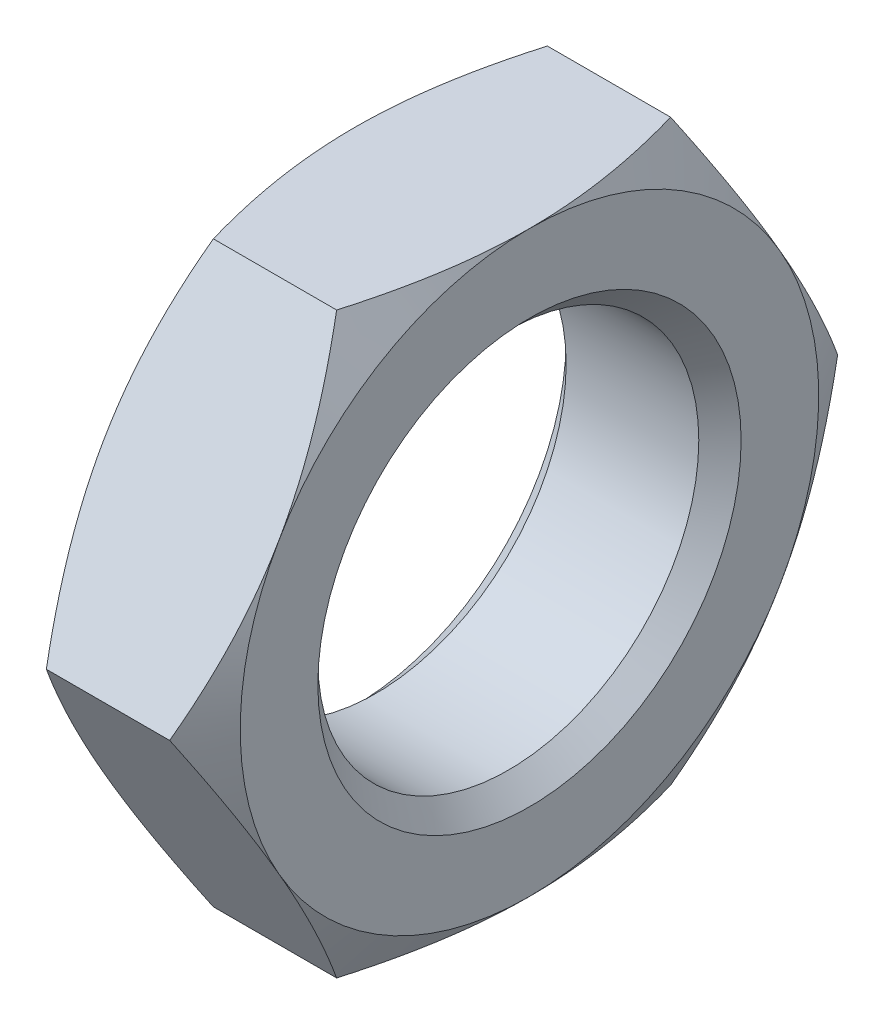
ISO-10303-21;
HEADER;
FILE_DESCRIPTION(('STEP AP214'),'2;1');
FILE_NAME('part.step','',(''),(''),'','','');
FILE_SCHEMA(('AUTOMOTIVE_DESIGN { 1 0 10303 214 1 1 1 1 }'));
ENDSEC;
DATA;
#1=APPLICATION_CONTEXT('core data for automotive mechanical design processes');
#2=APPLICATION_PROTOCOL_DEFINITION('international standard','automotive_design',2000,#1);
#3=PRODUCT_CONTEXT('',#1,'mechanical');
#4=PRODUCT('Part','Part','',(#3));
#5=PRODUCT_RELATED_PRODUCT_CATEGORY('part','',(#4));
#6=PRODUCT_DEFINITION_FORMATION('','',#4);
#7=PRODUCT_DEFINITION_CONTEXT('part definition',#1,'design');
#8=PRODUCT_DEFINITION('design','',#6,#7);
#9=PRODUCT_DEFINITION_SHAPE('','',#8);
#10=(LENGTH_UNIT() NAMED_UNIT(*) SI_UNIT(.MILLI.,.METRE.));
#11=(NAMED_UNIT(*) PLANE_ANGLE_UNIT() SI_UNIT($,.RADIAN.));
#12=(NAMED_UNIT(*) SI_UNIT($,.STERADIAN.) SOLID_ANGLE_UNIT());
#13=UNCERTAINTY_MEASURE_WITH_UNIT(LENGTH_MEASURE(1.E-05),#10,'distance_accuracy_value','');
#14=(GEOMETRIC_REPRESENTATION_CONTEXT(3) GLOBAL_UNCERTAINTY_ASSIGNED_CONTEXT((#13)) GLOBAL_UNIT_ASSIGNED_CONTEXT((#10,
#11,#12)) REPRESENTATION_CONTEXT('',''));
#15=CARTESIAN_POINT('',(0.,0.,0.));
#16=DIRECTION('',(0.,0.,1.));
#17=DIRECTION('',(1.,0.,0.));
#18=AXIS2_PLACEMENT_3D('',#15,#16,#17);
#19=CARTESIAN_POINT('',(12.4,20.5,-11.8356805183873));
#20=DIRECTION('',(1.,0.,0.));
#21=DIRECTION('',(0.,0.,-1.));
#22=AXIS2_PLACEMENT_3D('',#19,#20,#21);
#23=PLANE('',#22);
#24=CARTESIAN_POINT('',(12.4,0.,0.));
#25=DIRECTION('',(1.,0.,0.));
#26=DIRECTION('',(0.,0.,-1.));
#27=AXIS2_PLACEMENT_3D('',#24,#25,#26);
#28=CIRCLE('',#27,15.);
#29=CARTESIAN_POINT('',(12.4,0.,-15.));
#30=VERTEX_POINT('',#29);
#31=EDGE_CURVE('E11',#30,#30,#28,.F.);
#32=ORIENTED_EDGE('',*,*,#31,.T.);
#33=EDGE_LOOP('',(#32));
#34=FACE_BOUND('',#33,.T.);
#35=CARTESIAN_POINT('',(12.4,0.,0.));
#36=DIRECTION('',(1.,0.,0.));
#37=DIRECTION('',(0.,0.,-1.));
#38=AXIS2_PLACEMENT_3D('',#35,#36,#37);
#39=CIRCLE('',#38,20.5);
#40=CARTESIAN_POINT('',(12.4,-20.5,0.));
#41=VERTEX_POINT('',#40);
#42=CARTESIAN_POINT('',(12.4,-10.25,-17.753520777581));
#43=VERTEX_POINT('',#42);
#44=EDGE_CURVE('E142',#41,#43,#39,.T.);
#45=ORIENTED_EDGE('',*,*,#44,.T.);
#46=CARTESIAN_POINT('',(12.4,10.25,-17.753520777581));
#47=VERTEX_POINT('',#46);
#48=EDGE_CURVE('E130',#43,#47,#39,.T.);
#49=ORIENTED_EDGE('',*,*,#48,.T.);
#50=CARTESIAN_POINT('',(12.4,20.5,0.));
#51=VERTEX_POINT('',#50);
#52=EDGE_CURVE('E144',#47,#51,#39,.T.);
#53=ORIENTED_EDGE('',*,*,#52,.T.);
#54=CARTESIAN_POINT('',(12.4,10.25,17.753520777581));
#55=VERTEX_POINT('',#54);
#56=EDGE_CURVE('E55',#51,#55,#39,.T.);
#57=ORIENTED_EDGE('',*,*,#56,.T.);
#58=CARTESIAN_POINT('',(12.4,-10.25,17.753520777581));
#59=VERTEX_POINT('',#58);
#60=EDGE_CURVE('E63',#55,#59,#39,.T.);
#61=ORIENTED_EDGE('',*,*,#60,.T.);
#62=EDGE_CURVE('E166',#59,#41,#39,.T.);
#63=ORIENTED_EDGE('',*,*,#62,.T.);
#64=EDGE_LOOP('',(#45,#49,#53,#57,#61,#63));
#65=FACE_BOUND('',#64,.T.);
#66=ADVANCED_FACE('F39',(#34,#65),#23,.T.);
#67=CARTESIAN_POINT('',(0.,20.5,-11.8356805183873));
#68=DIRECTION('',(1.,0.,0.));
#69=DIRECTION('',(0.,0.,-1.));
#70=AXIS2_PLACEMENT_3D('',#67,#68,#69);
#71=PLANE('',#70);
#72=CARTESIAN_POINT('',(0.,0.,0.));
#73=DIRECTION('',(1.,0.,0.));
#74=DIRECTION('',(0.,0.,-1.));
#75=AXIS2_PLACEMENT_3D('',#72,#73,#74);
#76=CIRCLE('',#75,15.);
#77=CARTESIAN_POINT('',(0.,0.,15.));
#78=VERTEX_POINT('',#77);
#79=EDGE_CURVE('E164',#78,#78,#76,.T.);
#80=ORIENTED_EDGE('',*,*,#79,.T.);
#81=EDGE_LOOP('',(#80));
#82=FACE_BOUND('',#81,.T.);
#83=CARTESIAN_POINT('',(0.,0.,0.));
#84=DIRECTION('',(1.,0.,0.));
#85=DIRECTION('',(0.,0.,-1.));
#86=AXIS2_PLACEMENT_3D('',#83,#84,#85);
#87=CIRCLE('',#86,20.5);
#88=CARTESIAN_POINT('',(0.,-10.25,-17.753520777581));
#89=VERTEX_POINT('',#88);
#90=CARTESIAN_POINT('',(0.,10.25,-17.753520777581));
#91=VERTEX_POINT('',#90);
#92=EDGE_CURVE('E173',#89,#91,#87,.T.);
#93=ORIENTED_EDGE('',*,*,#92,.F.);
#94=CARTESIAN_POINT('',(0.,-20.5,0.));
#95=VERTEX_POINT('',#94);
#96=EDGE_CURVE('E321',#95,#89,#87,.T.);
#97=ORIENTED_EDGE('',*,*,#96,.F.);
#98=CARTESIAN_POINT('',(0.,-10.25,17.753520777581));
#99=VERTEX_POINT('',#98);
#100=EDGE_CURVE('E324',#99,#95,#87,.T.);
#101=ORIENTED_EDGE('',*,*,#100,.F.);
#102=CARTESIAN_POINT('',(0.,10.25,17.753520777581));
#103=VERTEX_POINT('',#102);
#104=EDGE_CURVE('E330',#103,#99,#87,.T.);
#105=ORIENTED_EDGE('',*,*,#104,.F.);
#106=CARTESIAN_POINT('',(0.,20.5,0.));
#107=VERTEX_POINT('',#106);
#108=EDGE_CURVE('E178',#107,#103,#87,.T.);
#109=ORIENTED_EDGE('',*,*,#108,.F.);
#110=EDGE_CURVE('E174',#91,#107,#87,.T.);
#111=ORIENTED_EDGE('',*,*,#110,.F.);
#112=EDGE_LOOP('',(#93,#97,#101,#105,#109,#111));
#113=FACE_BOUND('',#112,.T.);
#114=ADVANCED_FACE('F322',(#82,#113),#71,.F.);
#115=CARTESIAN_POINT('',(12.4,0.,0.));
#116=DIRECTION('',(-1.,0.,0.));
#117=DIRECTION('',(0.,0.,1.));
#118=AXIS2_PLACEMENT_3D('',#115,#116,#117);
#119=CYLINDRICAL_SURFACE('',#118,13.5);
#120=CARTESIAN_POINT('',(1.49999999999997,0.,0.));
#121=DIRECTION('',(1.,0.,0.));
#122=DIRECTION('',(0.,0.,-1.));
#123=AXIS2_PLACEMENT_3D('',#120,#121,#122);
#124=CIRCLE('',#123,13.5);
#125=CARTESIAN_POINT('',(1.49999999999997,0.,13.5));
#126=VERTEX_POINT('',#125);
#127=EDGE_CURVE('E48',#126,#126,#124,.F.);
#128=CARTESIAN_POINT('',(10.9,0.,0.));
#129=DIRECTION('',(1.,0.,0.));
#130=DIRECTION('',(0.,0.,-1.));
#131=AXIS2_PLACEMENT_3D('',#128,#129,#130);
#132=CIRCLE('',#131,13.5);
#133=CARTESIAN_POINT('',(10.9,0.,13.5));
#134=VERTEX_POINT('',#133);
#135=EDGE_CURVE('E407',#134,#134,#132,.T.);
#136=CARTESIAN_POINT('',(1.49999999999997,0.,13.5));
#137=CARTESIAN_POINT('',(1.59791666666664,0.,13.5));
#138=CARTESIAN_POINT('',(1.69583333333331,0.,13.5));
#139=CARTESIAN_POINT('',(1.89166666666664,0.,13.5));
#140=CARTESIAN_POINT('',(1.98958333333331,0.,13.5));
#141=CARTESIAN_POINT('',(2.18541666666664,0.,13.5));
#142=CARTESIAN_POINT('',(2.28333333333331,0.,13.5));
#143=CARTESIAN_POINT('',(2.47916666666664,0.,13.5));
#144=CARTESIAN_POINT('',(2.57708333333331,0.,13.5));
#145=CARTESIAN_POINT('',(2.77291666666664,0.,13.5));
#146=CARTESIAN_POINT('',(2.87083333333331,0.,13.5));
#147=CARTESIAN_POINT('',(3.06666666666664,0.,13.5));
#148=CARTESIAN_POINT('',(3.16458333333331,0.,13.5));
#149=CARTESIAN_POINT('',(3.36041666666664,0.,13.5));
#150=CARTESIAN_POINT('',(3.45833333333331,0.,13.5));
#151=CARTESIAN_POINT('',(3.65416666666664,0.,13.5));
#152=CARTESIAN_POINT('',(3.75208333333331,0.,13.5));
#153=CARTESIAN_POINT('',(3.94791666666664,0.,13.5));
#154=CARTESIAN_POINT('',(4.04583333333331,0.,13.5));
#155=CARTESIAN_POINT('',(4.24166666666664,0.,13.5));
#156=CARTESIAN_POINT('',(4.33958333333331,0.,13.5));
#157=CARTESIAN_POINT('',(4.53541666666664,0.,13.5));
#158=CARTESIAN_POINT('',(4.63333333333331,0.,13.5));
#159=CARTESIAN_POINT('',(4.82916666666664,0.,13.5));
#160=CARTESIAN_POINT('',(4.92708333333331,0.,13.5));
#161=CARTESIAN_POINT('',(5.12291666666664,0.,13.5));
#162=CARTESIAN_POINT('',(5.22083333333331,0.,13.5));
#163=CARTESIAN_POINT('',(5.41666666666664,0.,13.5));
#164=CARTESIAN_POINT('',(5.51458333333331,0.,13.5));
#165=CARTESIAN_POINT('',(5.71041666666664,0.,13.5));
#166=CARTESIAN_POINT('',(5.80833333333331,0.,13.5));
#167=CARTESIAN_POINT('',(6.00416666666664,0.,13.5));
#168=CARTESIAN_POINT('',(6.10208333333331,0.,13.5));
#169=CARTESIAN_POINT('',(6.29791666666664,0.,13.5));
#170=CARTESIAN_POINT('',(6.39583333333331,0.,13.5));
#171=CARTESIAN_POINT('',(6.59166666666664,0.,13.5));
#172=CARTESIAN_POINT('',(6.68958333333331,0.,13.5));
#173=CARTESIAN_POINT('',(6.88541666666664,0.,13.5));
#174=CARTESIAN_POINT('',(6.98333333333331,0.,13.5));
#175=CARTESIAN_POINT('',(7.17916666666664,0.,13.5));
#176=CARTESIAN_POINT('',(7.27708333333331,0.,13.5));
#177=CARTESIAN_POINT('',(7.47291666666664,0.,13.5));
#178=CARTESIAN_POINT('',(7.57083333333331,0.,13.5));
#179=CARTESIAN_POINT('',(7.76666666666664,0.,13.5));
#180=CARTESIAN_POINT('',(7.86458333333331,0.,13.5));
#181=CARTESIAN_POINT('',(8.06041666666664,0.,13.5));
#182=CARTESIAN_POINT('',(8.15833333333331,0.,13.5));
#183=CARTESIAN_POINT('',(8.35416666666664,0.,13.5));
#184=CARTESIAN_POINT('',(8.45208333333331,0.,13.5));
#185=CARTESIAN_POINT('',(8.64791666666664,0.,13.5));
#186=CARTESIAN_POINT('',(8.74583333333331,0.,13.5));
#187=CARTESIAN_POINT('',(8.94166666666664,0.,13.5));
#188=CARTESIAN_POINT('',(9.03958333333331,0.,13.5));
#189=CARTESIAN_POINT('',(9.23541666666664,0.,13.5));
#190=CARTESIAN_POINT('',(9.33333333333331,0.,13.5));
#191=CARTESIAN_POINT('',(9.52916666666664,0.,13.5));
#192=CARTESIAN_POINT('',(9.62708333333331,0.,13.5));
#193=CARTESIAN_POINT('',(9.82291666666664,0.,13.5));
#194=CARTESIAN_POINT('',(9.92083333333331,0.,13.5));
#195=CARTESIAN_POINT('',(10.1166666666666,0.,13.5));
#196=CARTESIAN_POINT('',(10.2145833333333,0.,13.5));
#197=CARTESIAN_POINT('',(10.4104166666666,0.,13.5));
#198=CARTESIAN_POINT('',(10.5083333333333,0.,13.5));
#199=CARTESIAN_POINT('',(10.7041666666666,0.,13.5));
#200=CARTESIAN_POINT('',(10.8020833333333,0.,13.5));
#201=CARTESIAN_POINT('',(10.9,0.,13.5));
#202=B_SPLINE_CURVE_WITH_KNOTS('',3,(#136,#137,#138,#139,#140,#141,#142,#143,#144,#145,#146,
#147,#148,#149,#150,#151,#152,#153,#154,#155,#156,#157,#158,#159,#160,#161,#162,#163,#164,#165,
#166,#167,#168,#169,#170,#171,#172,#173,#174,#175,#176,#177,#178,#179,#180,#181,#182,#183,#184,
#185,#186,#187,#188,#189,#190,#191,#192,#193,#194,#195,#196,#197,#198,#199,#200,#201),
.UNSPECIFIED.,.F.,.F.,(4,2,2,2,2,2,2,2,2,2,2,2,2,2,2,2,2,2,2,2,2,2,2,2,2,2,2,2,2,2,2,2,4),(0.,
0.293750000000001,0.587499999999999,0.88125,1.175,1.46875,1.7625,2.05625,2.35,2.64375,2.9375,
3.23125,3.525,3.81875,4.1125,4.40625,4.7,4.99375,5.2875,5.58125,5.875,6.16875,6.4625,6.75625,
7.05,7.34375,7.6375,7.93125,8.225,8.51875,8.8125,9.10625,9.4),.UNSPECIFIED.);
#203=EDGE_CURVE('BSEAM234',#126,#134,#202,.T.);
#204=ORIENTED_EDGE('',*,*,#127,.T.);
#205=ORIENTED_EDGE('',*,*,#135,.T.);
#206=ORIENTED_EDGE('',*,*,#203,.T.);
#207=ORIENTED_EDGE('',*,*,#203,.F.);
#208=EDGE_LOOP('',(#204,#206,#205,#207));
#209=FACE_BOUND('',#208,.T.);
#210=ADVANCED_FACE('F234',(#209),#119,.F.);
#211=CARTESIAN_POINT('',(0.,0.,0.));
#212=DIRECTION('',(1.,0.,0.));
#213=DIRECTION('',(0.,0.,-1.));
#214=AXIS2_PLACEMENT_3D('',#211,#212,#213);
#215=CONICAL_SURFACE('',#214,20.5,1.0471975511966);
#216=CARTESIAN_POINT('',(1.8310528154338,-20.5002,-11.8355650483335));
#217=CARTESIAN_POINT('',(1.68086967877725,-20.0496186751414,-12.0957082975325));
#218=CARTESIAN_POINT('',(1.5375016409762,-19.5972798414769,-12.3568662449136));
#219=CARTESIAN_POINT('',(1.26629011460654,-18.688974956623,-12.8812763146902));
#220=CARTESIAN_POINT('',(1.13845173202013,-18.2330077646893,-13.1445290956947));
#221=CARTESIAN_POINT('',(0.900017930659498,-17.3165649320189,-13.6736376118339));
#222=CARTESIAN_POINT('',(0.789463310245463,-16.8560812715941,-13.9394979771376));
#223=CARTESIAN_POINT('',(0.587971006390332,-15.9319142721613,-14.4730660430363));
#224=CARTESIAN_POINT('',(0.497032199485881,-15.4682311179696,-14.7407736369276));
#225=CARTESIAN_POINT('',(0.338639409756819,-14.5495462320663,-15.2711766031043));
#226=CARTESIAN_POINT('',(0.270661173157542,-14.0946127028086,-15.5338325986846));
#227=CARTESIAN_POINT('',(0.156677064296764,-13.1826610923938,-16.0603481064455));
#228=CARTESIAN_POINT('',(0.110671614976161,-12.7256429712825,-16.3242076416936));
#229=CARTESIAN_POINT('',(0.0417946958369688,-11.8108390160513,-16.8523699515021));
#230=CARTESIAN_POINT('',(0.0188957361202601,-11.3530547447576,-17.1166718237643));
#231=CARTESIAN_POINT('',(-0.00327576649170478,-10.4370637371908,-17.6455194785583));
#232=CARTESIAN_POINT('',(-0.00254903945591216,-9.97885701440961,-17.9100652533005));
#233=CARTESIAN_POINT('',(0.0208807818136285,-9.12223055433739,-18.4046387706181));
#234=CARTESIAN_POINT('',(0.0407268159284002,-8.72374981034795,-18.6347017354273));
#235=CARTESIAN_POINT('',(0.0979103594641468,-7.92773964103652,-19.094278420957));
#236=CARTESIAN_POINT('',(0.135247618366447,-7.5302102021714,-19.3237921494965));
#237=CARTESIAN_POINT('',(0.226766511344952,-6.7362495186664,-19.7821855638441));
#238=CARTESIAN_POINT('',(0.280963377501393,-6.33981959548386,-20.0110644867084));
#239=CARTESIAN_POINT('',(0.405242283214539,-5.54885793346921,-20.4677264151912));
#240=CARTESIAN_POINT('',(0.475324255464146,-5.15432618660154,-20.6955094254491));
#241=CARTESIAN_POINT('',(0.71119638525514,-3.95661173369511,-21.387010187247));
#242=CARTESIAN_POINT('',(0.900518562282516,-3.1568319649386,-21.8487632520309));
#243=CARTESIAN_POINT('',(1.22283076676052,-1.96599473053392,-22.5362934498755));
#244=CARTESIAN_POINT('',(1.3365403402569,-1.57086229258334,-22.7644232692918));
#245=CARTESIAN_POINT('',(1.57547119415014,-0.783330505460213,-23.2191049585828));
#246=CARTESIAN_POINT('',(1.70068922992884,-0.390930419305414,-23.4456572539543));
#247=CARTESIAN_POINT('',(1.8310528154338,0.000199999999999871,-23.6714765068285));
#248=B_SPLINE_CURVE_WITH_KNOTS('',3,(#216,#217,#218,#219,#220,#221,#222,#223,#224,#225,#226,
#227,#228,#229,#230,#231,#232,#233,#234,#235,#236,#237,#238,#239,#240,#241,#242,#243,#244,#245,
#246,#247),.UNSPECIFIED.,.F.,.F.,(4,2,2,2,2,2,2,2,2,2,2,2,2,2,2,4),(0.,1.62462772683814,
3.24978817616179,4.87872871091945,6.50757592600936,8.09621981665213,9.6848942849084,
11.2716764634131,12.8584096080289,14.2397371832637,15.6210449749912,17.0036043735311,
18.3861579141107,21.2121645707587,22.6227063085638,24.0328515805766),.UNSPECIFIED.);
#249=CARTESIAN_POINT('',(1.83098614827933,0.,-23.6713610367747));
#250=VERTEX_POINT('',#249);
#251=EDGE_CURVE('E336',#89,#250,#248,.T.);
#252=ORIENTED_EDGE('',*,*,#251,.F.);
#253=ORIENTED_EDGE('',*,*,#92,.T.);
#254=CARTESIAN_POINT('',(1.8310528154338,-0.000199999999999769,-23.6714765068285));
#255=CARTESIAN_POINT('',(1.68086967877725,0.450381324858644,-23.4113332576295));
#256=CARTESIAN_POINT('',(1.5375016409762,0.902720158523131,-23.1501753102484));
#257=CARTESIAN_POINT('',(1.26629011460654,1.81102504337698,-22.6257652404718));
#258=CARTESIAN_POINT('',(1.13845173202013,2.26699223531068,-22.3625124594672));
#259=CARTESIAN_POINT('',(0.900017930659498,3.1834350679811,-21.8334039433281));
#260=CARTESIAN_POINT('',(0.789463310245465,3.64391872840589,-21.5675435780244));
#261=CARTESIAN_POINT('',(0.587971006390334,4.5680857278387,-21.0339755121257));
#262=CARTESIAN_POINT('',(0.497032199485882,5.03176888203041,-20.7662679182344));
#263=CARTESIAN_POINT('',(0.338639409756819,5.95045376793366,-20.2358649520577));
#264=CARTESIAN_POINT('',(0.270661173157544,6.40538729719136,-19.9732089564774));
#265=CARTESIAN_POINT('',(0.156677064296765,7.3173389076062,-19.4466934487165));
#266=CARTESIAN_POINT('',(0.110671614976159,7.77435702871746,-19.1828339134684));
#267=CARTESIAN_POINT('',(0.0417946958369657,8.68916098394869,-18.6546716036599));
#268=CARTESIAN_POINT('',(0.0188957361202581,9.14694525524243,-18.3903697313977));
#269=CARTESIAN_POINT('',(-0.00327576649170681,10.0629362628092,-17.8615220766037));
#270=CARTESIAN_POINT('',(-0.00254903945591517,10.5211429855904,-17.5969763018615));
#271=CARTESIAN_POINT('',(0.0208807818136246,11.3777694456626,-17.1024027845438));
#272=CARTESIAN_POINT('',(0.0407268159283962,11.776250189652,-16.8723398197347));
#273=CARTESIAN_POINT('',(0.0979103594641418,12.5722603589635,-16.412763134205));
#274=CARTESIAN_POINT('',(0.135247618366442,12.9697897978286,-16.1832494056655));
#275=CARTESIAN_POINT('',(0.226766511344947,13.7637504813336,-15.7248559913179));
#276=CARTESIAN_POINT('',(0.280963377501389,14.1601804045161,-15.4959770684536));
#277=CARTESIAN_POINT('',(0.405242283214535,14.9511420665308,-15.0393151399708));
#278=CARTESIAN_POINT('',(0.475324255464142,15.3456738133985,-14.8115321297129));
#279=CARTESIAN_POINT('',(0.711196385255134,16.5433882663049,-14.120031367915));
#280=CARTESIAN_POINT('',(0.900518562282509,17.3431680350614,-13.658278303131));
#281=CARTESIAN_POINT('',(1.22283076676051,18.5340052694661,-12.9707481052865));
#282=CARTESIAN_POINT('',(1.33654034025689,18.9291377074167,-12.7426182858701));
#283=CARTESIAN_POINT('',(1.57547119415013,19.7166694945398,-12.2879365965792));
#284=CARTESIAN_POINT('',(1.70068922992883,20.1090695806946,-12.0613843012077));
#285=CARTESIAN_POINT('',(1.8310528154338,20.5002,-11.8355650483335));
#286=B_SPLINE_CURVE_WITH_KNOTS('',3,(#254,#255,#256,#257,#258,#259,#260,#261,#262,#263,#264,
#265,#266,#267,#268,#269,#270,#271,#272,#273,#274,#275,#276,#277,#278,#279,#280,#281,#282,#283,
#284,#285),.UNSPECIFIED.,.F.,.F.,(4,2,2,2,2,2,2,2,2,2,2,2,2,2,2,4),(0.,1.62462772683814,
3.24978817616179,4.87872871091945,6.50757592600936,8.09621981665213,9.68489428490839,
11.2716764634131,12.8584096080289,14.2397371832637,15.6210449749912,17.0036043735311,
18.3861579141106,21.2121645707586,22.6227063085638,24.0328515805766),.UNSPECIFIED.);
#287=EDGE_CURVE('E215',#250,#91,#286,.T.);
#288=ORIENTED_EDGE('',*,*,#287,.F.);
#289=EDGE_LOOP('',(#252,#253,#288));
#290=FACE_BOUND('',#289,.T.);
#291=ADVANCED_FACE('F194',(#290),#215,.T.);
#292=ORIENTED_EDGE('',*,*,#96,.T.);
#293=CARTESIAN_POINT('',(1.83098614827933,-20.5,-11.8356805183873));
#294=VERTEX_POINT('',#293);
#295=EDGE_CURVE('E156',#294,#89,#248,.T.);
#296=ORIENTED_EDGE('',*,*,#295,.F.);
#297=CARTESIAN_POINT('',(10.1055384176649,-20.5,-32.0000197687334));
#298=CARTESIAN_POINT('',(9.88748569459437,-20.5,-31.5514791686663));
#299=CARTESIAN_POINT('',(9.67050465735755,-20.5,-31.102417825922));
#300=CARTESIAN_POINT('',(9.23892825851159,-20.5,-30.2031450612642));
#301=CARTESIAN_POINT('',(9.02433292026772,-20.5,-29.75293362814));
#302=CARTESIAN_POINT('',(8.3844336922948,-20.5,-28.4002942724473));
#303=CARTESIAN_POINT('',(7.96307970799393,-20.5,-27.4959907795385));
#304=CARTESIAN_POINT('',(7.13118906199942,-20.5,-25.6765789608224));
#305=CARTESIAN_POINT('',(6.72072199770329,-20.5,-24.7614387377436));
#306=CARTESIAN_POINT('',(5.91630263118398,-20.5,-22.9239532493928));
#307=CARTESIAN_POINT('',(5.52234956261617,-20.5,-22.0016083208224));
#308=CARTESIAN_POINT('',(4.74265376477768,-20.5,-20.1176385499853));
#309=CARTESIAN_POINT('',(4.3576115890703,-20.5,-19.1557222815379));
#310=CARTESIAN_POINT('',(3.61616678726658,-20.5,-17.2207061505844));
#311=CARTESIAN_POINT('',(3.25976734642,-20.5,-16.2476050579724));
#312=CARTESIAN_POINT('',(2.58481801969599,-20.5,-14.290457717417));
#313=CARTESIAN_POINT('',(2.26619326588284,-20.5,-13.3064374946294));
#314=CARTESIAN_POINT('',(1.6768610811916,-20.5,-11.3241900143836));
#315=CARTESIAN_POINT('',(1.40613877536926,-20.5,-10.3259672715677));
#316=CARTESIAN_POINT('',(1.04642137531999,-20.5,-8.8205740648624));
#317=CARTESIAN_POINT('',(0.93449291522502,-20.5,-8.31885172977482));
#318=CARTESIAN_POINT('',(0.727402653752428,-20.5,-7.3119406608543));
#319=CARTESIAN_POINT('',(0.632240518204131,-20.5,-6.80675199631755));
#320=CARTESIAN_POINT('',(0.460351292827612,-20.5,-5.79325125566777));
#321=CARTESIAN_POINT('',(0.383623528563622,-20.5,-5.284939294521));
#322=CARTESIAN_POINT('',(0.250120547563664,-20.5,-4.26568391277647));
#323=CARTESIAN_POINT('',(0.193345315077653,-20.5,-3.75474049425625));
#324=CARTESIAN_POINT('',(0.101603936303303,-20.5,-2.73772687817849));
#325=CARTESIAN_POINT('',(0.0663582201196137,-20.5,-2.23168205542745));
#326=CARTESIAN_POINT('',(0.0173092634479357,-20.5,-1.21855561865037));
#327=CARTESIAN_POINT('',(0.00350566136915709,-20.5,-0.71147402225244));
#328=CARTESIAN_POINT('',(-0.00232987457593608,-20.5,0.302818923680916));
#329=CARTESIAN_POINT('',(0.00563822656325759,-20.5,0.810030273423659));
#330=CARTESIAN_POINT('',(0.0431491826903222,-20.5,1.82366046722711));
#331=CARTESIAN_POINT('',(0.0726930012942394,-20.5,2.33007927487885));
#332=CARTESIAN_POINT('',(0.168493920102,-20.5,3.5409236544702));
#333=CARTESIAN_POINT('',(0.244641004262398,-20.5,4.24458093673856));
#334=CARTESIAN_POINT('',(0.434492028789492,-20.5,5.64681352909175));
#335=CARTESIAN_POINT('',(0.548200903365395,-20.5,6.34538815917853));
#336=CARTESIAN_POINT('',(0.809130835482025,-20.5,7.73674189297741));
#337=CARTESIAN_POINT('',(0.956377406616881,-20.5,8.42951616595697));
#338=CARTESIAN_POINT('',(1.27987771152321,-20.5,9.80818446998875));
#339=CARTESIAN_POINT('',(1.45613105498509,-20.5,10.4940785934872));
#340=CARTESIAN_POINT('',(1.8375429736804,-20.5,11.8741920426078));
#341=CARTESIAN_POINT('',(2.0432579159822,-20.5,12.5682565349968));
#342=CARTESIAN_POINT('',(2.47636150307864,-20.5,13.9495513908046));
#343=CARTESIAN_POINT('',(2.70375029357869,-20.5,14.6367817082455));
#344=CARTESIAN_POINT('',(3.17655462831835,-20.5,16.0047404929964));
#345=CARTESIAN_POINT('',(3.42196446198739,-20.5,16.6854709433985));
#346=CARTESIAN_POINT('',(3.9278827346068,-20.5,18.0412634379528));
#347=CARTESIAN_POINT('',(4.18839097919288,-20.5,18.7163255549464));
#348=CARTESIAN_POINT('',(4.8299915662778,-20.5,20.3336108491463));
#349=CARTESIAN_POINT('',(5.21721949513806,-20.5,21.2733965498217));
#350=CARTESIAN_POINT('',(6.01113588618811,-20.5,23.1447373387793));
#351=CARTESIAN_POINT('',(6.41782566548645,-20.5,24.0762918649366));
#352=CARTESIAN_POINT('',(7.24669096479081,-20.5,25.932740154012));
#353=CARTESIAN_POINT('',(7.66887024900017,-20.5,26.8576322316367));
#354=CARTESIAN_POINT('',(8.52552390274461,-20.5,28.7016632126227));
#355=CARTESIAN_POINT('',(8.95999798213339,-20.5,29.6208022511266));
#356=CARTESIAN_POINT('',(9.83941186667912,-20.5,31.4553726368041));
#357=CARTESIAN_POINT('',(10.284363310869,-20.5,32.370798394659));
#358=CARTESIAN_POINT('',(11.18242270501,-20.5,34.1976397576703));
#359=CARTESIAN_POINT('',(11.6355306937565,-20.5,35.1090553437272));
#360=CARTESIAN_POINT('',(12.5484174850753,-20.5,36.9283783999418));
#361=CARTESIAN_POINT('',(13.008195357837,-20.5,37.8362863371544));
#362=CARTESIAN_POINT('',(13.9333705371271,-20.5,39.6492291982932));
#363=CARTESIAN_POINT('',(14.398767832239,-20.5,40.5542641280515));
#364=CARTESIAN_POINT('',(15.7210805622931,-20.5,43.1093126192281));
#365=CARTESIAN_POINT('',(16.5834997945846,-20.5,44.756477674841));
#366=CARTESIAN_POINT('',(18.320041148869,-20.5,48.0446937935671));
#367=CARTESIAN_POINT('',(19.1941637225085,-20.5,49.6857446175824));
#368=CARTESIAN_POINT('',(20.9490230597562,-20.5,52.9587366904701));
#369=CARTESIAN_POINT('',(21.8297363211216,-20.5,54.5906905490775));
#370=CARTESIAN_POINT('',(23.1559812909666,-20.5,57.035749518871));
#371=CARTESIAN_POINT('',(23.5989126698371,-20.5,57.8502671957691));
#372=CARTESIAN_POINT('',(24.4863268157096,-20.5,59.4784554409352));
#373=CARTESIAN_POINT('',(24.9308095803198,-20.5,60.2921260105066));
#374=CARTESIAN_POINT('',(25.375977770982,-20.5,61.1054215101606));
#375=B_SPLINE_CURVE_WITH_KNOTS('',3,(#297,#298,#299,#300,#301,#302,#303,#304,#305,#306,#307,
#308,#309,#310,#311,#312,#313,#314,#315,#316,#317,#318,#319,#320,#321,#322,#323,#324,#325,#326,
#327,#328,#329,#330,#331,#332,#333,#334,#335,#336,#337,#338,#339,#340,#341,#342,#343,#344,#345,
#346,#347,#348,#349,#350,#351,#352,#353,#354,#355,#356,#357,#358,#359,#360,#361,#362,#363,#364,
#365,#366,#367,#368,#369,#370,#371,#372,#373,#374),.UNSPECIFIED.,.F.,.F.,(4,2,2,2,2,2,2,2,2,2,2,
2,2,2,2,2,2,2,2,2,2,2,2,2,2,2,2,2,2,2,2,2,2,2,2,2,2,2,4),(0.,1.49619952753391,2.99241369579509,
5.98527416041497,8.99408087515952,12.0027478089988,15.1107532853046,18.2191039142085,
21.3211871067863,24.4223053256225,25.9642376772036,27.5061392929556,29.0479844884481,
30.5898284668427,32.1111999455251,33.6325457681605,35.1538940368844,36.6753102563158,
38.7974370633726,40.9198427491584,43.043868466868,45.167865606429,47.3391703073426,
49.5104896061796,51.6811237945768,53.8517300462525,56.9007376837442,59.9499519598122,
62.9999122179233,66.0498005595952,69.1032536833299,72.1567213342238,75.209767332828,
78.2628071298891,83.8405735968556,89.4185559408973,94.9818380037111,97.7633193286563,
100.54479636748),.UNSPECIFIED.);
#376=EDGE_CURVE('E177',#95,#294,#375,.F.);
#377=ORIENTED_EDGE('',*,*,#376,.F.);
#378=EDGE_LOOP('',(#292,#296,#377));
#379=FACE_BOUND('',#378,.T.);
#380=ADVANCED_FACE('F351',(#379),#215,.T.);
#381=CARTESIAN_POINT('',(6.2,0.,0.));
#382=DIRECTION('',(-1.,0.,0.));
#383=DIRECTION('',(0.,0.,1.));
#384=AXIS2_PLACEMENT_3D('',#381,#382,#383);
#385=CONICAL_SURFACE('',#384,31.2387150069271,1.0471975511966);
#386=CARTESIAN_POINT('',(10.5689471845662,0.000200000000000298,-23.6714765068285));
#387=CARTESIAN_POINT('',(10.7191303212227,-0.450381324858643,-23.4113332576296));
#388=CARTESIAN_POINT('',(10.8624983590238,-0.90272015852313,-23.1501753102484));
#389=CARTESIAN_POINT('',(11.1337098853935,-1.81102504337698,-22.6257652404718));
#390=CARTESIAN_POINT('',(11.2615482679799,-2.26699223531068,-22.3625124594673));
#391=CARTESIAN_POINT('',(11.4999820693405,-3.1834350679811,-21.8334039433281));
#392=CARTESIAN_POINT('',(11.6105366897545,-3.6439187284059,-21.5675435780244));
#393=CARTESIAN_POINT('',(11.8120289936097,-4.5680857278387,-21.0339755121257));
#394=CARTESIAN_POINT('',(11.9029678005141,-5.03176888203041,-20.7662679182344));
#395=CARTESIAN_POINT('',(12.0613605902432,-5.95045376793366,-20.2358649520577));
#396=CARTESIAN_POINT('',(12.1293388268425,-6.40538729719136,-19.9732089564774));
#397=CARTESIAN_POINT('',(12.2433229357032,-7.3173389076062,-19.4466934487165));
#398=CARTESIAN_POINT('',(12.2893283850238,-7.77435702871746,-19.1828339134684));
#399=CARTESIAN_POINT('',(12.358205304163,-8.6891609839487,-18.6546716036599));
#400=CARTESIAN_POINT('',(12.3811042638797,-9.14694525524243,-18.3903697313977));
#401=CARTESIAN_POINT('',(12.4032757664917,-10.0629362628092,-17.8615220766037));
#402=CARTESIAN_POINT('',(12.4025490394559,-10.5211429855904,-17.5969763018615));
#403=CARTESIAN_POINT('',(12.3791192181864,-11.3777694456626,-17.1024027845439));
#404=CARTESIAN_POINT('',(12.3592731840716,-11.7762501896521,-16.8723398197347));
#405=CARTESIAN_POINT('',(12.3020896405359,-12.5722603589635,-16.412763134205));
#406=CARTESIAN_POINT('',(12.2647523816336,-12.9697897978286,-16.1832494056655));
#407=CARTESIAN_POINT('',(12.173233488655,-13.7637504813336,-15.7248559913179));
#408=CARTESIAN_POINT('',(12.1190366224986,-14.1601804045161,-15.4959770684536));
#409=CARTESIAN_POINT('',(11.9947577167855,-14.9511420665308,-15.0393151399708));
#410=CARTESIAN_POINT('',(11.9246757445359,-15.3456738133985,-14.8115321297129));
#411=CARTESIAN_POINT('',(11.6888036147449,-16.5433882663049,-14.120031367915));
#412=CARTESIAN_POINT('',(11.4994814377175,-17.3431680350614,-13.658278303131));
#413=CARTESIAN_POINT('',(11.1771692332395,-18.5340052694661,-12.9707481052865));
#414=CARTESIAN_POINT('',(11.0634596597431,-18.9291377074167,-12.7426182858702));
#415=CARTESIAN_POINT('',(10.8245288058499,-19.7166694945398,-12.2879365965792));
#416=CARTESIAN_POINT('',(10.6993107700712,-20.1090695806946,-12.0613843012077));
#417=CARTESIAN_POINT('',(10.5689471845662,-20.5002,-11.8355650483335));
#418=B_SPLINE_CURVE_WITH_KNOTS('',3,(#386,#387,#388,#389,#390,#391,#392,#393,#394,#395,#396,
#397,#398,#399,#400,#401,#402,#403,#404,#405,#406,#407,#408,#409,#410,#411,#412,#413,#414,#415,
#416,#417),.UNSPECIFIED.,.F.,.F.,(4,2,2,2,2,2,2,2,2,2,2,2,2,2,2,4),(0.,1.62462772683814,
3.24978817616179,4.87872871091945,6.50757592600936,8.09621981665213,9.68489428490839,
11.2716764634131,12.8584096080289,14.2397371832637,15.6210449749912,17.0036043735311,
18.3861579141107,21.2121645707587,22.6227063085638,24.0328515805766),.UNSPECIFIED.);
#419=CARTESIAN_POINT('',(10.5690138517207,-20.5,-11.8356805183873));
#420=VERTEX_POINT('',#419);
#421=EDGE_CURVE('E147',#43,#420,#418,.T.);
#422=ORIENTED_EDGE('',*,*,#421,.F.);
#423=ORIENTED_EDGE('',*,*,#44,.F.);
#424=CARTESIAN_POINT('',(2.29446158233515,-20.5,-32.0000197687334));
#425=CARTESIAN_POINT('',(2.51251430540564,-20.5,-31.5514791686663));
#426=CARTESIAN_POINT('',(2.72949534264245,-20.5,-31.102417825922));
#427=CARTESIAN_POINT('',(3.16107174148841,-20.5,-30.2031450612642));
#428=CARTESIAN_POINT('',(3.37566707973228,-20.5,-29.75293362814));
#429=CARTESIAN_POINT('',(4.0155663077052,-20.5,-28.4002942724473));
#430=CARTESIAN_POINT('',(4.43692029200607,-20.5,-27.4959907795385));
#431=CARTESIAN_POINT('',(5.26881093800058,-20.5,-25.6765789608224));
#432=CARTESIAN_POINT('',(5.67927800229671,-20.5,-24.7614387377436));
#433=CARTESIAN_POINT('',(6.48369736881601,-20.5,-22.9239532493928));
#434=CARTESIAN_POINT('',(6.87765043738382,-20.5,-22.0016083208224));
#435=CARTESIAN_POINT('',(7.65734623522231,-20.5,-20.1176385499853));
#436=CARTESIAN_POINT('',(8.0423884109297,-20.5,-19.1557222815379));
#437=CARTESIAN_POINT('',(8.78383321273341,-20.5,-17.2207061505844));
#438=CARTESIAN_POINT('',(9.14023265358,-20.5,-16.2476050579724));
#439=CARTESIAN_POINT('',(9.81518198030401,-20.5,-14.290457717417));
#440=CARTESIAN_POINT('',(10.1338067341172,-20.5,-13.3064374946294));
#441=CARTESIAN_POINT('',(10.7231389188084,-20.5,-11.3241900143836));
#442=CARTESIAN_POINT('',(10.9938612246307,-20.5,-10.3259672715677));
#443=CARTESIAN_POINT('',(11.35357862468,-20.5,-8.8205740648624));
#444=CARTESIAN_POINT('',(11.465507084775,-20.5,-8.31885172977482));
#445=CARTESIAN_POINT('',(11.6725973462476,-20.5,-7.3119406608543));
#446=CARTESIAN_POINT('',(11.7677594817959,-20.5,-6.80675199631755));
#447=CARTESIAN_POINT('',(11.9396487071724,-20.5,-5.79325125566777));
#448=CARTESIAN_POINT('',(12.0163764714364,-20.5,-5.284939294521));
#449=CARTESIAN_POINT('',(12.1498794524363,-20.5,-4.26568391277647));
#450=CARTESIAN_POINT('',(12.2066546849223,-20.5,-3.75474049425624));
#451=CARTESIAN_POINT('',(12.2983960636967,-20.5,-2.73772687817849));
#452=CARTESIAN_POINT('',(12.3336417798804,-20.5,-2.23168205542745));
#453=CARTESIAN_POINT('',(12.3826907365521,-20.5,-1.21855561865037));
#454=CARTESIAN_POINT('',(12.3964943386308,-20.5,-0.71147402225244));
#455=CARTESIAN_POINT('',(12.4023298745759,-20.5,0.302818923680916));
#456=CARTESIAN_POINT('',(12.3943617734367,-20.5,0.810030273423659));
#457=CARTESIAN_POINT('',(12.3568508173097,-20.5,1.82366046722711));
#458=CARTESIAN_POINT('',(12.3273069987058,-20.5,2.33007927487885));
#459=CARTESIAN_POINT('',(12.231506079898,-20.5,3.5409236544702));
#460=CARTESIAN_POINT('',(12.1553589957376,-20.5,4.24458093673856));
#461=CARTESIAN_POINT('',(11.9655079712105,-20.5,5.64681352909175));
#462=CARTESIAN_POINT('',(11.8517990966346,-20.5,6.34538815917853));
#463=CARTESIAN_POINT('',(11.590869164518,-20.5,7.73674189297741));
#464=CARTESIAN_POINT('',(11.4436225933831,-20.5,8.42951616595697));
#465=CARTESIAN_POINT('',(11.1201222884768,-20.5,9.80818446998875));
#466=CARTESIAN_POINT('',(10.9438689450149,-20.5,10.4940785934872));
#467=CARTESIAN_POINT('',(10.5624570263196,-20.5,11.8741920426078));
#468=CARTESIAN_POINT('',(10.3567420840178,-20.5,12.5682565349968));
#469=CARTESIAN_POINT('',(9.92363849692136,-20.5,13.9495513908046));
#470=CARTESIAN_POINT('',(9.69624970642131,-20.5,14.6367817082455));
#471=CARTESIAN_POINT('',(9.22344537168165,-20.5,16.0047404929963));
#472=CARTESIAN_POINT('',(8.97803553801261,-20.5,16.6854709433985));
#473=CARTESIAN_POINT('',(8.47211726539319,-20.5,18.0412634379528));
#474=CARTESIAN_POINT('',(8.21160902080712,-20.5,18.7163255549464));
#475=CARTESIAN_POINT('',(7.5700084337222,-20.5,20.3336108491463));
#476=CARTESIAN_POINT('',(7.18278050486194,-20.5,21.2733965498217));
#477=CARTESIAN_POINT('',(6.38886411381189,-20.5,23.1447373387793));
#478=CARTESIAN_POINT('',(5.98217433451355,-20.5,24.0762918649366));
#479=CARTESIAN_POINT('',(5.1533090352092,-20.5,25.932740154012));
#480=CARTESIAN_POINT('',(4.73112975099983,-20.5,26.8576322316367));
#481=CARTESIAN_POINT('',(3.87447609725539,-20.5,28.7016632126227));
#482=CARTESIAN_POINT('',(3.44000201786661,-20.5,29.6208022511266));
#483=CARTESIAN_POINT('',(2.56058813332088,-20.5,31.4553726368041));
#484=CARTESIAN_POINT('',(2.11563668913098,-20.5,32.370798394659));
#485=CARTESIAN_POINT('',(1.21757729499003,-20.5,34.1976397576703));
#486=CARTESIAN_POINT('',(0.764469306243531,-20.5,35.1090553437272));
#487=CARTESIAN_POINT('',(-0.148417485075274,-20.5,36.9283783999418));
#488=CARTESIAN_POINT('',(-0.608195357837,-20.5,37.8362863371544));
#489=CARTESIAN_POINT('',(-1.53337053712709,-20.5,39.6492291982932));
#490=CARTESIAN_POINT('',(-1.99876783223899,-20.5,40.5542641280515));
#491=CARTESIAN_POINT('',(-3.32108056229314,-20.5,43.1093126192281));
#492=CARTESIAN_POINT('',(-4.18349979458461,-20.5,44.756477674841));
#493=CARTESIAN_POINT('',(-5.92004114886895,-20.5,48.0446937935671));
#494=CARTESIAN_POINT('',(-6.79416372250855,-20.5,49.6857446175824));
#495=CARTESIAN_POINT('',(-8.54902305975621,-20.5,52.9587366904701));
#496=CARTESIAN_POINT('',(-9.42973632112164,-20.5,54.5906905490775));
#497=CARTESIAN_POINT('',(-10.7559812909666,-20.5,57.035749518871));
#498=CARTESIAN_POINT('',(-11.1989126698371,-20.5,57.8502671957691));
#499=CARTESIAN_POINT('',(-12.0863268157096,-20.5,59.4784554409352));
#500=CARTESIAN_POINT('',(-12.5308095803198,-20.5,60.2921260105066));
#501=CARTESIAN_POINT('',(-12.975977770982,-20.5,61.1054215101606));
#502=B_SPLINE_CURVE_WITH_KNOTS('',3,(#424,#425,#426,#427,#428,#429,#430,#431,#432,#433,#434,
#435,#436,#437,#438,#439,#440,#441,#442,#443,#444,#445,#446,#447,#448,#449,#450,#451,#452,#453,
#454,#455,#456,#457,#458,#459,#460,#461,#462,#463,#464,#465,#466,#467,#468,#469,#470,#471,#472,
#473,#474,#475,#476,#477,#478,#479,#480,#481,#482,#483,#484,#485,#486,#487,#488,#489,#490,#491,
#492,#493,#494,#495,#496,#497,#498,#499,#500,#501),.UNSPECIFIED.,.F.,.F.,(4,2,2,2,2,2,2,2,2,2,2,
2,2,2,2,2,2,2,2,2,2,2,2,2,2,2,2,2,2,2,2,2,2,2,2,2,2,2,4),(0.,1.49619952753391,2.99241369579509,
5.98527416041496,8.99408087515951,12.0027478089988,15.1107532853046,18.2191039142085,
21.3211871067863,24.4223053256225,25.9642376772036,27.5061392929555,29.047984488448,
30.5898284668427,32.1111999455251,33.6325457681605,35.1538940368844,36.6753102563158,
38.7974370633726,40.9198427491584,43.0438684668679,45.167865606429,47.3391703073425,
49.5104896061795,51.6811237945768,53.8517300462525,56.9007376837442,59.9499519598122,
62.9999122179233,66.0498005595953,69.1032536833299,72.1567213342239,75.209767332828,
78.2628071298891,83.8405735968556,89.4185559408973,94.9818380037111,97.7633193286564,
100.54479636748),.UNSPECIFIED.);
#503=EDGE_CURVE('E151',#420,#41,#502,.T.);
#504=ORIENTED_EDGE('',*,*,#503,.F.);
#505=EDGE_LOOP('',(#422,#423,#504));
#506=FACE_BOUND('',#505,.T.);
#507=ADVANCED_FACE('F148',(#506),#385,.T.);
#508=ORIENTED_EDGE('',*,*,#48,.F.);
#509=CARTESIAN_POINT('',(10.5690138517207,0.,-23.6713610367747));
#510=VERTEX_POINT('',#509);
#511=EDGE_CURVE('E134',#510,#43,#418,.T.);
#512=ORIENTED_EDGE('',*,*,#511,.F.);
#513=CARTESIAN_POINT('',(10.5689471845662,20.5002,-11.8355650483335));
#514=CARTESIAN_POINT('',(10.7191303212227,20.0496186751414,-12.0957082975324));
#515=CARTESIAN_POINT('',(10.8624983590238,19.5972798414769,-12.3568662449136));
#516=CARTESIAN_POINT('',(11.1337098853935,18.688974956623,-12.8812763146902));
#517=CARTESIAN_POINT('',(11.2615482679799,18.2330077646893,-13.1445290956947));
#518=CARTESIAN_POINT('',(11.4999820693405,17.3165649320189,-13.6736376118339));
#519=CARTESIAN_POINT('',(11.6105366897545,16.8560812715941,-13.9394979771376));
#520=CARTESIAN_POINT('',(11.8120289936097,15.9319142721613,-14.4730660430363));
#521=CARTESIAN_POINT('',(11.9029678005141,15.4682311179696,-14.7407736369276));
#522=CARTESIAN_POINT('',(12.0613605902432,14.5495462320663,-15.2711766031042));
#523=CARTESIAN_POINT('',(12.1293388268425,14.0946127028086,-15.5338325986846));
#524=CARTESIAN_POINT('',(12.2433229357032,13.1826610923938,-16.0603481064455));
#525=CARTESIAN_POINT('',(12.2893283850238,12.7256429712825,-16.3242076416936));
#526=CARTESIAN_POINT('',(12.358205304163,11.8108390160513,-16.8523699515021));
#527=CARTESIAN_POINT('',(12.3811042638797,11.3530547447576,-17.1166718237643));
#528=CARTESIAN_POINT('',(12.4032757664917,10.4370637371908,-17.6455194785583));
#529=CARTESIAN_POINT('',(12.4025490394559,9.97885701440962,-17.9100652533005));
#530=CARTESIAN_POINT('',(12.3791192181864,9.12223055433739,-18.4046387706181));
#531=CARTESIAN_POINT('',(12.3592731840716,8.72374981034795,-18.6347017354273));
#532=CARTESIAN_POINT('',(12.3020896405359,7.92773964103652,-19.094278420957));
#533=CARTESIAN_POINT('',(12.2647523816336,7.5302102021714,-19.3237921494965));
#534=CARTESIAN_POINT('',(12.173233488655,6.7362495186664,-19.7821855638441));
#535=CARTESIAN_POINT('',(12.1190366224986,6.33981959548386,-20.0110644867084));
#536=CARTESIAN_POINT('',(11.9947577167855,5.54885793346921,-20.4677264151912));
#537=CARTESIAN_POINT('',(11.9246757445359,5.15432618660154,-20.6955094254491));
#538=CARTESIAN_POINT('',(11.6888036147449,3.95661173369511,-21.387010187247));
#539=CARTESIAN_POINT('',(11.4994814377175,3.15683196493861,-21.8487632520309));
#540=CARTESIAN_POINT('',(11.1771692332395,1.96599473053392,-22.5362934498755));
#541=CARTESIAN_POINT('',(11.0634596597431,1.57086229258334,-22.7644232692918));
#542=CARTESIAN_POINT('',(10.8245288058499,0.783330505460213,-23.2191049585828));
#543=CARTESIAN_POINT('',(10.6993107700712,0.390930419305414,-23.4456572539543));
#544=CARTESIAN_POINT('',(10.5689471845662,-0.00020000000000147,-23.6714765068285));
#545=B_SPLINE_CURVE_WITH_KNOTS('',3,(#513,#514,#515,#516,#517,#518,#519,#520,#521,#522,#523,
#524,#525,#526,#527,#528,#529,#530,#531,#532,#533,#534,#535,#536,#537,#538,#539,#540,#541,#542,
#543,#544),.UNSPECIFIED.,.F.,.F.,(4,2,2,2,2,2,2,2,2,2,2,2,2,2,2,4),(0.,1.62462772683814,
3.24978817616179,4.87872871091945,6.50757592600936,8.09621981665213,9.68489428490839,
11.2716764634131,12.8584096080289,14.2397371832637,15.6210449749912,17.0036043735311,
18.3861579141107,21.2121645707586,22.6227063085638,24.0328515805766),.UNSPECIFIED.);
#546=EDGE_CURVE('E136',#47,#510,#545,.T.);
#547=ORIENTED_EDGE('',*,*,#546,.F.);
#548=EDGE_LOOP('',(#508,#512,#547));
#549=FACE_BOUND('',#548,.T.);
#550=ADVANCED_FACE('F132',(#549),#385,.T.);
#551=ORIENTED_EDGE('',*,*,#100,.T.);
#552=CARTESIAN_POINT('',(1.83098614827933,-20.5,11.8356805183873));
#553=VERTEX_POINT('',#552);
#554=EDGE_CURVE('E187',#553,#95,#375,.F.);
#555=ORIENTED_EDGE('',*,*,#554,.F.);
#556=CARTESIAN_POINT('',(1.8310528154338,0.000200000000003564,23.6714765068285));
#557=CARTESIAN_POINT('',(1.68086967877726,-0.450381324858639,23.4113332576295));
#558=CARTESIAN_POINT('',(1.53750164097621,-0.902720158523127,23.1501753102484));
#559=CARTESIAN_POINT('',(1.26629011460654,-1.81102504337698,22.6257652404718));
#560=CARTESIAN_POINT('',(1.13845173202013,-2.26699223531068,22.3625124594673));
#561=CARTESIAN_POINT('',(0.900017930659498,-3.1834350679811,21.8334039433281));
#562=CARTESIAN_POINT('',(0.789463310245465,-3.64391872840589,21.5675435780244));
#563=CARTESIAN_POINT('',(0.587971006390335,-4.56808572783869,21.0339755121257));
#564=CARTESIAN_POINT('',(0.497032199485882,-5.0317688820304,20.7662679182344));
#565=CARTESIAN_POINT('',(0.33863940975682,-5.95045376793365,20.2358649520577));
#566=CARTESIAN_POINT('',(0.270661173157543,-6.40538729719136,19.9732089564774));
#567=CARTESIAN_POINT('',(0.156677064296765,-7.3173389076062,19.4466934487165));
#568=CARTESIAN_POINT('',(0.11067161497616,-7.77435702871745,19.1828339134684));
#569=CARTESIAN_POINT('',(0.0417946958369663,-8.68916098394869,18.6546716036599));
#570=CARTESIAN_POINT('',(0.0188957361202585,-9.14694525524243,18.3903697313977));
#571=CARTESIAN_POINT('',(-0.00327576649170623,-10.0629362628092,17.8615220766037));
#572=CARTESIAN_POINT('',(-0.00254903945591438,-10.5211429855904,17.5969763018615));
#573=CARTESIAN_POINT('',(0.0208807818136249,-11.3777694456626,17.1024027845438));
#574=CARTESIAN_POINT('',(0.0407268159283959,-11.776250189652,16.8723398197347));
#575=CARTESIAN_POINT('',(0.0979103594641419,-12.5722603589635,16.412763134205));
#576=CARTESIAN_POINT('',(0.135247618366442,-12.9697897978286,16.1832494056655));
#577=CARTESIAN_POINT('',(0.226766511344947,-13.7637504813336,15.7248559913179));
#578=CARTESIAN_POINT('',(0.280963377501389,-14.1601804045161,15.4959770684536));
#579=CARTESIAN_POINT('',(0.405242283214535,-14.9511420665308,15.0393151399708));
#580=CARTESIAN_POINT('',(0.475324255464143,-15.3456738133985,14.8115321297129));
#581=CARTESIAN_POINT('',(0.711196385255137,-16.5433882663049,14.120031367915));
#582=CARTESIAN_POINT('',(0.900518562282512,-17.3431680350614,13.658278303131));
#583=CARTESIAN_POINT('',(1.22283076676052,-18.5340052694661,12.9707481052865));
#584=CARTESIAN_POINT('',(1.33654034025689,-18.9291377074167,12.7426182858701));
#585=CARTESIAN_POINT('',(1.57547119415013,-19.7166694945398,12.2879365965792));
#586=CARTESIAN_POINT('',(1.70068922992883,-20.1090695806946,12.0613843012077));
#587=CARTESIAN_POINT('',(1.8310528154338,-20.5002,11.8355650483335));
#588=B_SPLINE_CURVE_WITH_KNOTS('',3,(#556,#557,#558,#559,#560,#561,#562,#563,#564,#565,#566,
#567,#568,#569,#570,#571,#572,#573,#574,#575,#576,#577,#578,#579,#580,#581,#582,#583,#584,#585,
#586,#587),.UNSPECIFIED.,.F.,.F.,(4,2,2,2,2,2,2,2,2,2,2,2,2,2,2,4),(0.,1.62462772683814,
3.24978817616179,4.87872871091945,6.50757592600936,8.09621981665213,9.68489428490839,
11.2716764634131,12.8584096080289,14.2397371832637,15.6210449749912,17.0036043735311,
18.3861579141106,21.2121645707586,22.6227063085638,24.0328515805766),.UNSPECIFIED.);
#589=EDGE_CURVE('E188',#99,#553,#588,.T.);
#590=ORIENTED_EDGE('',*,*,#589,.F.);
#591=EDGE_LOOP('',(#551,#555,#590));
#592=FACE_BOUND('',#591,.T.);
#593=ADVANCED_FACE('F350',(#592),#215,.T.);
#594=CARTESIAN_POINT('',(10.5690138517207,-20.5,11.8356805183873));
#595=VERTEX_POINT('',#594);
#596=EDGE_CURVE('E216',#41,#595,#502,.T.);
#597=ORIENTED_EDGE('',*,*,#596,.F.);
#598=ORIENTED_EDGE('',*,*,#62,.F.);
#599=CARTESIAN_POINT('',(10.5689471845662,-20.5002,11.8355650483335));
#600=CARTESIAN_POINT('',(10.7191303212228,-20.0496186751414,12.0957082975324));
#601=CARTESIAN_POINT('',(10.8624983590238,-19.5972798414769,12.3568662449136));
#602=CARTESIAN_POINT('',(11.1337098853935,-18.688974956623,12.8812763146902));
#603=CARTESIAN_POINT('',(11.2615482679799,-18.2330077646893,13.1445290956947));
#604=CARTESIAN_POINT('',(11.4999820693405,-17.3165649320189,13.6736376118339));
#605=CARTESIAN_POINT('',(11.6105366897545,-16.8560812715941,13.9394979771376));
#606=CARTESIAN_POINT('',(11.8120289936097,-15.9319142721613,14.4730660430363));
#607=CARTESIAN_POINT('',(11.9029678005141,-15.4682311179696,14.7407736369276));
#608=CARTESIAN_POINT('',(12.0613605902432,-14.5495462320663,15.2711766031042));
#609=CARTESIAN_POINT('',(12.1293388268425,-14.0946127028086,15.5338325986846));
#610=CARTESIAN_POINT('',(12.2433229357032,-13.1826610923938,16.0603481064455));
#611=CARTESIAN_POINT('',(12.2893283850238,-12.7256429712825,16.3242076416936));
#612=CARTESIAN_POINT('',(12.358205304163,-11.8108390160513,16.8523699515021));
#613=CARTESIAN_POINT('',(12.3811042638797,-11.3530547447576,17.1166718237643));
#614=CARTESIAN_POINT('',(12.4032757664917,-10.4370637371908,17.6455194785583));
#615=CARTESIAN_POINT('',(12.4025490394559,-9.97885701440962,17.9100652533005));
#616=CARTESIAN_POINT('',(12.3791192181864,-9.12223055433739,18.4046387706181));
#617=CARTESIAN_POINT('',(12.3592731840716,-8.72374981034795,18.6347017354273));
#618=CARTESIAN_POINT('',(12.3020896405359,-7.92773964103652,19.094278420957));
#619=CARTESIAN_POINT('',(12.2647523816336,-7.5302102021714,19.3237921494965));
#620=CARTESIAN_POINT('',(12.1732334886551,-6.7362495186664,19.7821855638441));
#621=CARTESIAN_POINT('',(12.1190366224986,-6.33981959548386,20.0110644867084));
#622=CARTESIAN_POINT('',(11.9947577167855,-5.54885793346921,20.4677264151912));
#623=CARTESIAN_POINT('',(11.9246757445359,-5.15432618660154,20.6955094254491));
#624=CARTESIAN_POINT('',(11.6888036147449,-3.95661173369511,21.387010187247));
#625=CARTESIAN_POINT('',(11.4994814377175,-3.1568319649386,21.8487632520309));
#626=CARTESIAN_POINT('',(11.1771692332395,-1.96599473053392,22.5362934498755));
#627=CARTESIAN_POINT('',(11.0634596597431,-1.57086229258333,22.7644232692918));
#628=CARTESIAN_POINT('',(10.8245288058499,-0.783330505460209,23.2191049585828));
#629=CARTESIAN_POINT('',(10.6993107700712,-0.390930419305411,23.4456572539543));
#630=CARTESIAN_POINT('',(10.5689471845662,0.000200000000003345,23.6714765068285));
#631=B_SPLINE_CURVE_WITH_KNOTS('',3,(#599,#600,#601,#602,#603,#604,#605,#606,#607,#608,#609,
#610,#611,#612,#613,#614,#615,#616,#617,#618,#619,#620,#621,#622,#623,#624,#625,#626,#627,#628,
#629,#630),.UNSPECIFIED.,.F.,.F.,(4,2,2,2,2,2,2,2,2,2,2,2,2,2,2,4),(0.,1.62462772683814,
3.24978817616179,4.87872871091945,6.50757592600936,8.09621981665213,9.68489428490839,
11.2716764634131,12.8584096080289,14.2397371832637,15.6210449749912,17.0036043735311,
18.3861579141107,21.2121645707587,22.6227063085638,24.0328515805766),.UNSPECIFIED.);
#632=EDGE_CURVE('E247',#595,#59,#631,.T.);
#633=ORIENTED_EDGE('',*,*,#632,.F.);
#634=EDGE_LOOP('',(#597,#598,#633));
#635=FACE_BOUND('',#634,.T.);
#636=ADVANCED_FACE('F393',(#635),#385,.T.);
#637=ORIENTED_EDGE('',*,*,#104,.T.);
#638=CARTESIAN_POINT('',(1.83098614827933,0.,23.6713610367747));
#639=VERTEX_POINT('',#638);
#640=EDGE_CURVE('E288',#639,#99,#588,.T.);
#641=ORIENTED_EDGE('',*,*,#640,.F.);
#642=CARTESIAN_POINT('',(1.8310528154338,20.5002,11.8355650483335));
#643=CARTESIAN_POINT('',(1.68086967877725,20.0496186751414,12.0957082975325));
#644=CARTESIAN_POINT('',(1.5375016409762,19.5972798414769,12.3568662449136));
#645=CARTESIAN_POINT('',(1.26629011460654,18.688974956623,12.8812763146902));
#646=CARTESIAN_POINT('',(1.13845173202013,18.2330077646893,13.1445290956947));
#647=CARTESIAN_POINT('',(0.900017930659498,17.3165649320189,13.6736376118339));
#648=CARTESIAN_POINT('',(0.789463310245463,16.8560812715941,13.9394979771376));
#649=CARTESIAN_POINT('',(0.587971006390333,15.9319142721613,14.4730660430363));
#650=CARTESIAN_POINT('',(0.497032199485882,15.4682311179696,14.7407736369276));
#651=CARTESIAN_POINT('',(0.33863940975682,14.5495462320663,15.2711766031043));
#652=CARTESIAN_POINT('',(0.270661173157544,14.0946127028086,15.5338325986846));
#653=CARTESIAN_POINT('',(0.156677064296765,13.1826610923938,16.0603481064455));
#654=CARTESIAN_POINT('',(0.110671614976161,12.7256429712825,16.3242076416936));
#655=CARTESIAN_POINT('',(0.0417946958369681,11.8108390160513,16.8523699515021));
#656=CARTESIAN_POINT('',(0.0188957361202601,11.3530547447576,17.1166718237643));
#657=CARTESIAN_POINT('',(-0.00327576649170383,10.4370637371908,17.6455194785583));
#658=CARTESIAN_POINT('',(-0.00254903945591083,9.97885701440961,17.9100652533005));
#659=CARTESIAN_POINT('',(0.0208807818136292,9.12223055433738,18.4046387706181));
#660=CARTESIAN_POINT('',(0.0407268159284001,8.72374981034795,18.6347017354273));
#661=CARTESIAN_POINT('',(0.0979103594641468,7.92773964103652,19.094278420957));
#662=CARTESIAN_POINT('',(0.135247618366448,7.5302102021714,19.3237921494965));
#663=CARTESIAN_POINT('',(0.226766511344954,6.7362495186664,19.7821855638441));
#664=CARTESIAN_POINT('',(0.280963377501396,6.33981959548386,20.0110644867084));
#665=CARTESIAN_POINT('',(0.405242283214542,5.54885793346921,20.4677264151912));
#666=CARTESIAN_POINT('',(0.475324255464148,5.15432618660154,20.6955094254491));
#667=CARTESIAN_POINT('',(0.71119638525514,3.95661173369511,21.387010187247));
#668=CARTESIAN_POINT('',(0.900518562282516,3.15683196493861,21.8487632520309));
#669=CARTESIAN_POINT('',(1.22283076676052,1.96599473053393,22.5362934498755));
#670=CARTESIAN_POINT('',(1.3365403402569,1.57086229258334,22.7644232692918));
#671=CARTESIAN_POINT('',(1.57547119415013,0.783330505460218,23.2191049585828));
#672=CARTESIAN_POINT('',(1.70068922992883,0.39093041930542,23.4456572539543));
#673=CARTESIAN_POINT('',(1.8310528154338,-0.000199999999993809,23.6714765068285));
#674=B_SPLINE_CURVE_WITH_KNOTS('',3,(#642,#643,#644,#645,#646,#647,#648,#649,#650,#651,#652,
#653,#654,#655,#656,#657,#658,#659,#660,#661,#662,#663,#664,#665,#666,#667,#668,#669,#670,#671,
#672,#673),.UNSPECIFIED.,.F.,.F.,(4,2,2,2,2,2,2,2,2,2,2,2,2,2,2,4),(0.,1.62462772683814,
3.24978817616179,4.87872871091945,6.50757592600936,8.09621981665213,9.68489428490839,
11.2716764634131,12.8584096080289,14.2397371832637,15.6210449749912,17.0036043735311,
18.3861579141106,21.2121645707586,22.6227063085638,24.0328515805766),.UNSPECIFIED.);
#675=EDGE_CURVE('E282',#103,#639,#674,.T.);
#676=ORIENTED_EDGE('',*,*,#675,.F.);
#677=EDGE_LOOP('',(#637,#641,#676));
#678=FACE_BOUND('',#677,.T.);
#679=ADVANCED_FACE('F232',(#678),#215,.T.);
#680=CARTESIAN_POINT('',(10.5690138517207,0.,23.6713610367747));
#681=VERTEX_POINT('',#680);
#682=EDGE_CURVE('E376',#59,#681,#631,.T.);
#683=ORIENTED_EDGE('',*,*,#682,.F.);
#684=ORIENTED_EDGE('',*,*,#60,.F.);
#685=CARTESIAN_POINT('',(10.5689471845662,-0.000199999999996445,23.6714765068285));
#686=CARTESIAN_POINT('',(10.7191303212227,0.450381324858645,23.4113332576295));
#687=CARTESIAN_POINT('',(10.8624983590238,0.902720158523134,23.1501753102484));
#688=CARTESIAN_POINT('',(11.1337098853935,1.81102504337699,22.6257652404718));
#689=CARTESIAN_POINT('',(11.2615482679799,2.26699223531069,22.3625124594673));
#690=CARTESIAN_POINT('',(11.4999820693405,3.18343506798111,21.8334039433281));
#691=CARTESIAN_POINT('',(11.6105366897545,3.6439187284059,21.5675435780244));
#692=CARTESIAN_POINT('',(11.8120289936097,4.5680857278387,21.0339755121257));
#693=CARTESIAN_POINT('',(11.9029678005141,5.03176888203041,20.7662679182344));
#694=CARTESIAN_POINT('',(12.0613605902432,5.95045376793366,20.2358649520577));
#695=CARTESIAN_POINT('',(12.1293388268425,6.40538729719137,19.9732089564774));
#696=CARTESIAN_POINT('',(12.2433229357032,7.31733890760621,19.4466934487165));
#697=CARTESIAN_POINT('',(12.2893283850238,7.77435702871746,19.1828339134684));
#698=CARTESIAN_POINT('',(12.358205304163,8.6891609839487,18.6546716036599));
#699=CARTESIAN_POINT('',(12.3811042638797,9.14694525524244,18.3903697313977));
#700=CARTESIAN_POINT('',(12.4032757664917,10.0629362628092,17.8615220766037));
#701=CARTESIAN_POINT('',(12.4025490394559,10.5211429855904,17.5969763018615));
#702=CARTESIAN_POINT('',(12.3791192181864,11.3777694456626,17.1024027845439));
#703=CARTESIAN_POINT('',(12.3592731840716,11.7762501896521,16.8723398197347));
#704=CARTESIAN_POINT('',(12.3020896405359,12.5722603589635,16.412763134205));
#705=CARTESIAN_POINT('',(12.2647523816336,12.9697897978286,16.1832494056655));
#706=CARTESIAN_POINT('',(12.173233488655,13.7637504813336,15.7248559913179));
#707=CARTESIAN_POINT('',(12.1190366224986,14.1601804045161,15.4959770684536));
#708=CARTESIAN_POINT('',(11.9947577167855,14.9511420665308,15.0393151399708));
#709=CARTESIAN_POINT('',(11.9246757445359,15.3456738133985,14.8115321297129));
#710=CARTESIAN_POINT('',(11.6888036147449,16.5433882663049,14.120031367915));
#711=CARTESIAN_POINT('',(11.4994814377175,17.3431680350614,13.6582783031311));
#712=CARTESIAN_POINT('',(11.1771692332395,18.5340052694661,12.9707481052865));
#713=CARTESIAN_POINT('',(11.0634596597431,18.9291377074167,12.7426182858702));
#714=CARTESIAN_POINT('',(10.8245288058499,19.7166694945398,12.2879365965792));
#715=CARTESIAN_POINT('',(10.6993107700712,20.1090695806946,12.0613843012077));
#716=CARTESIAN_POINT('',(10.5689471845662,20.5002,11.8355650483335));
#717=B_SPLINE_CURVE_WITH_KNOTS('',3,(#685,#686,#687,#688,#689,#690,#691,#692,#693,#694,#695,
#696,#697,#698,#699,#700,#701,#702,#703,#704,#705,#706,#707,#708,#709,#710,#711,#712,#713,#714,
#715,#716),.UNSPECIFIED.,.F.,.F.,(4,2,2,2,2,2,2,2,2,2,2,2,2,2,2,4),(0.,1.62462772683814,
3.24978817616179,4.87872871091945,6.50757592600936,8.09621981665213,9.68489428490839,
11.2716764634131,12.8584096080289,14.2397371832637,15.6210449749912,17.0036043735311,
18.3861579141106,21.2121645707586,22.6227063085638,24.0328515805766),.UNSPECIFIED.);
#718=EDGE_CURVE('E371',#681,#55,#717,.T.);
#719=ORIENTED_EDGE('',*,*,#718,.F.);
#720=EDGE_LOOP('',(#683,#684,#719));
#721=FACE_BOUND('',#720,.T.);
#722=ADVANCED_FACE('F227',(#721),#385,.T.);
#723=ORIENTED_EDGE('',*,*,#108,.T.);
#724=CARTESIAN_POINT('',(1.83098614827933,20.5,11.8356805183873));
#725=VERTEX_POINT('',#724);
#726=EDGE_CURVE('E281',#725,#103,#674,.T.);
#727=ORIENTED_EDGE('',*,*,#726,.F.);
#728=CARTESIAN_POINT('',(10.1055384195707,20.5,-32.0000197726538));
#729=CARTESIAN_POINT('',(9.88748569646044,20.5,-31.5514791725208));
#730=CARTESIAN_POINT('',(9.67050465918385,20.5,-31.1024178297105));
#731=CARTESIAN_POINT('',(9.23892826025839,20.5,-30.2031450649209));
#732=CARTESIAN_POINT('',(9.0243329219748,20.5,-29.7529336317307));
#733=CARTESIAN_POINT('',(8.38443369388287,20.5,-28.4002942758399));
#734=CARTESIAN_POINT('',(7.96307970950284,20.5,-27.4959907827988));
#735=CARTESIAN_POINT('',(7.13118906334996,20.5,-25.6765789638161));
#736=CARTESIAN_POINT('',(6.72072199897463,20.5,-24.7614387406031));
#737=CARTESIAN_POINT('',(5.91630263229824,20.5,-22.9239532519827));
#738=CARTESIAN_POINT('',(5.52234956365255,20.5,-22.001608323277));
#739=CARTESIAN_POINT('',(4.74265376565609,20.5,-20.117638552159));
#740=CARTESIAN_POINT('',(4.3576115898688,20.5,-19.1557222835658));
#741=CARTESIAN_POINT('',(3.61616678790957,20.5,-17.2207061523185));
#742=CARTESIAN_POINT('',(3.25976734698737,20.5,-16.2476050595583));
#743=CARTESIAN_POINT('',(2.58481802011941,20.5,-14.290457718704));
#744=CARTESIAN_POINT('',(2.26619326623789,20.5,-13.3064374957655));
#745=CARTESIAN_POINT('',(1.67686108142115,20.5,-11.3241900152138));
#746=CARTESIAN_POINT('',(1.40613877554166,20.5,-10.3259672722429));
#747=CARTESIAN_POINT('',(1.04642137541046,20.5,-8.82057406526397));
#748=CARTESIAN_POINT('',(0.934492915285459,20.5,-8.31885173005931));
#749=CARTESIAN_POINT('',(0.727402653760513,20.5,-7.31194066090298));
#750=CARTESIAN_POINT('',(0.632240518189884,20.5,-6.80675199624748));
#751=CARTESIAN_POINT('',(0.460351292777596,20.5,-5.79325125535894));
#752=CARTESIAN_POINT('',(0.383623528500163,20.5,-5.28493929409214));
#753=CARTESIAN_POINT('',(0.250120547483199,20.5,-4.26568391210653));
#754=CARTESIAN_POINT('',(0.193345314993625,20.5,-3.75474049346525));
#755=CARTESIAN_POINT('',(0.101603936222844,20.5,-2.73772687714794));
#756=CARTESIAN_POINT('',(0.0663582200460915,20.5,-2.23168205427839));
#757=CARTESIAN_POINT('',(0.0173092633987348,20.5,-1.21855561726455));
#758=CARTESIAN_POINT('',(0.00350566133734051,20.5,-0.711474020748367));
#759=CARTESIAN_POINT('',(-0.00232987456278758,20.5,0.302818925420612));
#760=CARTESIAN_POINT('',(0.00563822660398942,20.5,0.810030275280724));
#761=CARTESIAN_POINT('',(0.0431491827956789,20.5,1.82366046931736));
#762=CARTESIAN_POINT('',(0.0726930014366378,20.5,2.33007927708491));
#763=CARTESIAN_POINT('',(0.168493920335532,20.5,3.54092365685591));
#764=CARTESIAN_POINT('',(0.244641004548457,20.5,4.24458093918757));
#765=CARTESIAN_POINT('',(0.434492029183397,20.5,5.64681353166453));
#766=CARTESIAN_POINT('',(0.548200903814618,20.5,6.34538816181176));
#767=CARTESIAN_POINT('',(0.809130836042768,20.5,7.73674189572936));
#768=CARTESIAN_POINT('',(0.956377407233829,20.5,8.42951616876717));
#769=CARTESIAN_POINT('',(1.27987771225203,20.5,9.80818447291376));
#770=CARTESIAN_POINT('',(1.45613105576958,20.5,10.4940785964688));
#771=CARTESIAN_POINT('',(1.83754297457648,20.5,11.874192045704));
#772=CARTESIAN_POINT('',(2.04325791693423,20.5,12.568256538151));
#773=CARTESIAN_POINT('',(2.47636150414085,20.5,13.9495513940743));
#774=CARTESIAN_POINT('',(2.70375029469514,20.5,14.6367817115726));
#775=CARTESIAN_POINT('',(3.17655462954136,20.5,16.0047404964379));
#776=CARTESIAN_POINT('',(3.42196446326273,20.5,16.6854709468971));
#777=CARTESIAN_POINT('',(3.92788273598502,20.5,18.0412634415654));
#778=CARTESIAN_POINT('',(4.18839098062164,20.5,18.716325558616));
#779=CARTESIAN_POINT('',(4.82999156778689,20.5,20.3336108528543));
#780=CARTESIAN_POINT('',(5.21721949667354,20.5,21.2733965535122));
#781=CARTESIAN_POINT('',(6.01113588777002,20.5,23.1447373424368));
#782=CARTESIAN_POINT('',(6.41782566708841,20.5,24.0762918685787));
#783=CARTESIAN_POINT('',(7.246690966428,20.5,25.9327401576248));
#784=CARTESIAN_POINT('',(7.66887025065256,20.5,26.8576322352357));
#785=CARTESIAN_POINT('',(8.52552390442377,20.5,28.7016632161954));
#786=CARTESIAN_POINT('',(8.95999798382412,20.5,29.6208022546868));
#787=CARTESIAN_POINT('',(9.83941186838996,20.5,31.45537264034));
#788=CARTESIAN_POINT('',(10.2843633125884,20.5,32.3707983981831));
#789=CARTESIAN_POINT('',(11.1824227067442,20.5,34.1976397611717));
#790=CARTESIAN_POINT('',(11.6355306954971,20.5,35.1090553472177));
#791=CARTESIAN_POINT('',(12.548417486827,20.5,36.9283784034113));
#792=CARTESIAN_POINT('',(13.0081953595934,20.5,37.8362863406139));
#793=CARTESIAN_POINT('',(13.9333705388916,20.5,39.6492292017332));
#794=CARTESIAN_POINT('',(14.3987678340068,20.5,40.5542641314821));
#795=CARTESIAN_POINT('',(15.7210805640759,20.5,43.109312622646));
#796=CARTESIAN_POINT('',(16.5834997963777,20.5,44.7564776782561));
#797=CARTESIAN_POINT('',(18.3200411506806,20.5,48.0446937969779));
#798=CARTESIAN_POINT('',(19.1941637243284,20.5,49.6857446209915));
#799=CARTESIAN_POINT('',(20.949023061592,20.5,52.9587366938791));
#800=CARTESIAN_POINT('',(21.8297363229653,20.5,54.5906905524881));
#801=CARTESIAN_POINT('',(23.1559812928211,20.5,57.0357495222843));
#802=CARTESIAN_POINT('',(23.5989126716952,20.5,57.8502671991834));
#803=CARTESIAN_POINT('',(24.4863268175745,20.5,59.4784554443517));
#804=CARTESIAN_POINT('',(24.930809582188,20.5,60.2921260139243));
#805=CARTESIAN_POINT('',(25.3759777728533,20.5,61.1054215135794));
#806=B_SPLINE_CURVE_WITH_KNOTS('',3,(#728,#729,#730,#731,#732,#733,#734,#735,#736,#737,#738,
#739,#740,#741,#742,#743,#744,#745,#746,#747,#748,#749,#750,#751,#752,#753,#754,#755,#756,#757,
#758,#759,#760,#761,#762,#763,#764,#765,#766,#767,#768,#769,#770,#771,#772,#773,#774,#775,#776,
#777,#778,#779,#780,#781,#782,#783,#784,#785,#786,#787,#788,#789,#790,#791,#792,#793,#794,#795,
#796,#797,#798,#799,#800,#801,#802,#803,#804,#805),.UNSPECIFIED.,.F.,.F.,(4,2,2,2,2,2,2,2,2,2,2,
2,2,2,2,2,2,2,2,2,2,2,2,2,2,2,2,2,2,2,2,2,2,2,2,2,2,2,4),(0.,1.49619952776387,2.99241369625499,
5.98527416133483,8.9940808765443,12.0027478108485,15.1107532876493,18.2191039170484,
21.3211871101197,24.422305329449,25.9642376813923,27.5061392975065,29.0479844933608,
30.5898284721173,32.1111999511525,33.6325457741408,35.1538940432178,36.6753102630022,
38.7974370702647,40.9198427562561,43.0438684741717,45.1678656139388,47.339170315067,
49.5104896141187,51.6811238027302,53.8517300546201,56.9007376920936,59.9499519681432,
62.9999122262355,66.0498005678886,69.1032536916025,72.1567213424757,75.2097673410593,
78.2628071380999,83.8405736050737,89.4185559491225,94.9818380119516,97.7633193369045,
100.544796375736),.UNSPECIFIED.);
#807=EDGE_CURVE('E274',#107,#725,#806,.T.);
#808=ORIENTED_EDGE('',*,*,#807,.F.);
#809=EDGE_LOOP('',(#723,#727,#808));
#810=FACE_BOUND('',#809,.T.);
#811=ADVANCED_FACE('F231',(#810),#215,.T.);
#812=ORIENTED_EDGE('',*,*,#56,.F.);
#813=CARTESIAN_POINT('',(2.29446158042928,20.5,-32.0000197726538));
#814=CARTESIAN_POINT('',(2.51251430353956,20.5,-31.5514791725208));
#815=CARTESIAN_POINT('',(2.72949534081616,20.5,-31.1024178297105));
#816=CARTESIAN_POINT('',(3.16107173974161,20.5,-30.2031450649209));
#817=CARTESIAN_POINT('',(3.3756670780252,20.5,-29.7529336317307));
#818=CARTESIAN_POINT('',(4.01556630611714,20.5,-28.4002942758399));
#819=CARTESIAN_POINT('',(4.43692029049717,20.5,-27.4959907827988));
#820=CARTESIAN_POINT('',(5.26881093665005,20.5,-25.6765789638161));
#821=CARTESIAN_POINT('',(5.67927800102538,20.5,-24.761438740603));
#822=CARTESIAN_POINT('',(6.48369736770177,20.5,-22.9239532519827));
#823=CARTESIAN_POINT('',(6.87765043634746,20.5,-22.001608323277));
#824=CARTESIAN_POINT('',(7.65734623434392,20.5,-20.117638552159));
#825=CARTESIAN_POINT('',(8.0423884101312,20.5,-19.1557222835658));
#826=CARTESIAN_POINT('',(8.78383321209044,20.5,-17.2207061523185));
#827=CARTESIAN_POINT('',(9.14023265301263,20.5,-16.2476050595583));
#828=CARTESIAN_POINT('',(9.8151819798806,20.5,-14.290457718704));
#829=CARTESIAN_POINT('',(10.1338067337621,20.5,-13.3064374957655));
#830=CARTESIAN_POINT('',(10.7231389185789,20.5,-11.3241900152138));
#831=CARTESIAN_POINT('',(10.9938612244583,20.5,-10.3259672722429));
#832=CARTESIAN_POINT('',(11.3535786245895,20.5,-8.82057406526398));
#833=CARTESIAN_POINT('',(11.4655070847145,20.5,-8.31885173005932));
#834=CARTESIAN_POINT('',(11.6725973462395,20.5,-7.31194066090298));
#835=CARTESIAN_POINT('',(11.7677594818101,20.5,-6.80675199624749));
#836=CARTESIAN_POINT('',(11.9396487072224,20.5,-5.79325125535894));
#837=CARTESIAN_POINT('',(12.0163764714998,20.5,-5.28493929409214));
#838=CARTESIAN_POINT('',(12.1498794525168,20.5,-4.26568391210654));
#839=CARTESIAN_POINT('',(12.2066546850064,20.5,-3.75474049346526));
#840=CARTESIAN_POINT('',(12.2983960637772,20.5,-2.73772687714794));
#841=CARTESIAN_POINT('',(12.3336417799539,20.5,-2.23168205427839));
#842=CARTESIAN_POINT('',(12.3826907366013,20.5,-1.21855561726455));
#843=CARTESIAN_POINT('',(12.3964943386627,20.5,-0.71147402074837));
#844=CARTESIAN_POINT('',(12.4023298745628,20.5,0.302818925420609));
#845=CARTESIAN_POINT('',(12.394361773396,20.5,0.810030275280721));
#846=CARTESIAN_POINT('',(12.3568508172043,20.5,1.82366046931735));
#847=CARTESIAN_POINT('',(12.3273069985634,20.5,2.33007927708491));
#848=CARTESIAN_POINT('',(12.2315060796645,20.5,3.54092365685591));
#849=CARTESIAN_POINT('',(12.1553589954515,20.5,4.24458093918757));
#850=CARTESIAN_POINT('',(11.9655079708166,20.5,5.64681353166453));
#851=CARTESIAN_POINT('',(11.8517990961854,20.5,6.34538816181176));
#852=CARTESIAN_POINT('',(11.5908691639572,20.5,7.73674189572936));
#853=CARTESIAN_POINT('',(11.4436225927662,20.5,8.42951616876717));
#854=CARTESIAN_POINT('',(11.120122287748,20.5,9.80818447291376));
#855=CARTESIAN_POINT('',(10.9438689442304,20.5,10.4940785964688));
#856=CARTESIAN_POINT('',(10.5624570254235,20.5,11.874192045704));
#857=CARTESIAN_POINT('',(10.3567420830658,20.5,12.568256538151));
#858=CARTESIAN_POINT('',(9.92363849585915,20.5,13.9495513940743));
#859=CARTESIAN_POINT('',(9.69624970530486,20.5,14.6367817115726));
#860=CARTESIAN_POINT('',(9.22344537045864,20.5,16.0047404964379));
#861=CARTESIAN_POINT('',(8.97803553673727,20.5,16.685470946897));
#862=CARTESIAN_POINT('',(8.47211726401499,20.5,18.0412634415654));
#863=CARTESIAN_POINT('',(8.21160901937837,20.5,18.716325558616));
#864=CARTESIAN_POINT('',(7.57000843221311,20.5,20.3336108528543));
#865=CARTESIAN_POINT('',(7.18278050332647,20.5,21.2733965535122));
#866=CARTESIAN_POINT('',(6.38886411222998,20.5,23.1447373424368));
#867=CARTESIAN_POINT('',(5.9821743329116,20.5,24.0762918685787));
#868=CARTESIAN_POINT('',(5.15330903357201,20.5,25.9327401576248));
#869=CARTESIAN_POINT('',(4.73112974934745,20.5,26.8576322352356));
#870=CARTESIAN_POINT('',(3.87447609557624,20.5,28.7016632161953));
#871=CARTESIAN_POINT('',(3.44000201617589,20.5,29.6208022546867));
#872=CARTESIAN_POINT('',(2.56058813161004,20.5,31.45537264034));
#873=CARTESIAN_POINT('',(2.11563668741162,20.5,32.3707983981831));
#874=CARTESIAN_POINT('',(1.21757729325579,20.5,34.1976397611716));
#875=CARTESIAN_POINT('',(0.76446930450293,20.5,35.1090553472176));
#876=CARTESIAN_POINT('',(-0.148417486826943,20.5,36.9283784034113));
#877=CARTESIAN_POINT('',(-0.608195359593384,20.5,37.8362863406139));
#878=CARTESIAN_POINT('',(-1.53337053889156,20.5,39.6492292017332));
#879=CARTESIAN_POINT('',(-1.99876783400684,20.5,40.5542641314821));
#880=CARTESIAN_POINT('',(-3.32108056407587,20.5,43.109312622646));
#881=CARTESIAN_POINT('',(-4.18349979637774,20.5,44.7564776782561));
#882=CARTESIAN_POINT('',(-5.92004115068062,20.5,48.0446937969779));
#883=CARTESIAN_POINT('',(-6.79416372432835,20.5,49.6857446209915));
#884=CARTESIAN_POINT('',(-8.54902306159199,20.5,52.9587366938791));
#885=CARTESIAN_POINT('',(-9.42973632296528,20.5,54.5906905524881));
#886=CARTESIAN_POINT('',(-10.7559812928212,20.5,57.0357495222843));
#887=CARTESIAN_POINT('',(-11.1989126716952,20.5,57.8502671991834));
#888=CARTESIAN_POINT('',(-12.0863268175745,20.5,59.4784554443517));
#889=CARTESIAN_POINT('',(-12.530809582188,20.5,60.2921260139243));
#890=CARTESIAN_POINT('',(-12.9759777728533,20.5,61.1054215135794));
#891=B_SPLINE_CURVE_WITH_KNOTS('',3,(#813,#814,#815,#816,#817,#818,#819,#820,#821,#822,#823,
#824,#825,#826,#827,#828,#829,#830,#831,#832,#833,#834,#835,#836,#837,#838,#839,#840,#841,#842,
#843,#844,#845,#846,#847,#848,#849,#850,#851,#852,#853,#854,#855,#856,#857,#858,#859,#860,#861,
#862,#863,#864,#865,#866,#867,#868,#869,#870,#871,#872,#873,#874,#875,#876,#877,#878,#879,#880,
#881,#882,#883,#884,#885,#886,#887,#888,#889,#890),.UNSPECIFIED.,.F.,.F.,(4,2,2,2,2,2,2,2,2,2,2,
2,2,2,2,2,2,2,2,2,2,2,2,2,2,2,2,2,2,2,2,2,2,2,2,2,2,2,4),(0.,1.49619952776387,2.99241369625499,
5.98527416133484,8.99408087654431,12.0027478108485,15.1107532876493,18.2191039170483,
21.3211871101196,24.4223053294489,25.9642376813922,27.5061392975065,29.0479844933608,
30.5898284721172,32.1111999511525,33.6325457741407,35.1538940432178,36.6753102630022,
38.7974370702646,40.9198427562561,43.0438684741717,45.1678656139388,47.339170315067,
49.5104896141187,51.6811238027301,53.8517300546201,56.9007376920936,59.9499519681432,
62.9999122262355,66.0498005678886,69.1032536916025,72.1567213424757,75.2097673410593,
78.2628071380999,83.8405736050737,89.4185559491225,94.9818380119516,97.7633193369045,
100.544796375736),.UNSPECIFIED.);
#892=CARTESIAN_POINT('',(10.5690138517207,20.5,11.8356805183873));
#893=VERTEX_POINT('',#892);
#894=EDGE_CURVE('E259',#893,#51,#891,.F.);
#895=ORIENTED_EDGE('',*,*,#894,.F.);
#896=EDGE_CURVE('E260',#55,#893,#717,.T.);
#897=ORIENTED_EDGE('',*,*,#896,.F.);
#898=EDGE_LOOP('',(#812,#895,#897));
#899=FACE_BOUND('',#898,.T.);
#900=ADVANCED_FACE('F233',(#899),#385,.T.);
#901=ORIENTED_EDGE('',*,*,#110,.T.);
#902=CARTESIAN_POINT('',(1.83098614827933,20.5,-11.8356805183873));
#903=VERTEX_POINT('',#902);
#904=EDGE_CURVE('E280',#903,#107,#806,.T.);
#905=ORIENTED_EDGE('',*,*,#904,.F.);
#906=EDGE_CURVE('E217',#91,#903,#286,.T.);
#907=ORIENTED_EDGE('',*,*,#906,.F.);
#908=EDGE_LOOP('',(#901,#905,#907));
#909=FACE_BOUND('',#908,.T.);
#910=ADVANCED_FACE('F339',(#909),#215,.T.);
#911=ORIENTED_EDGE('',*,*,#52,.F.);
#912=CARTESIAN_POINT('',(10.5690138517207,20.5,-11.8356805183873));
#913=VERTEX_POINT('',#912);
#914=EDGE_CURVE('E382',#913,#47,#545,.T.);
#915=ORIENTED_EDGE('',*,*,#914,.F.);
#916=EDGE_CURVE('E252',#51,#913,#891,.F.);
#917=ORIENTED_EDGE('',*,*,#916,.F.);
#918=EDGE_LOOP('',(#911,#915,#917));
#919=FACE_BOUND('',#918,.T.);
#920=ADVANCED_FACE('F386',(#919),#385,.T.);
#921=CARTESIAN_POINT('',(12.4,-20.5,-11.8356805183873));
#922=DIRECTION('',(0.,0.5,0.866025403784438));
#923=DIRECTION('',(0.,-0.866025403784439,0.5));
#924=AXIS2_PLACEMENT_3D('',#921,#922,#923);
#925=PLANE('',#924);
#926=DIRECTION('',(-1.,0.,0.));
#927=VECTOR('',#926,1.);
#928=CARTESIAN_POINT('',(12.4,0.,-23.6713610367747));
#929=LINE('',#928,#927);
#930=EDGE_CURVE('E162',#510,#250,#929,.T.);
#931=ORIENTED_EDGE('',*,*,#930,.F.);
#932=ORIENTED_EDGE('',*,*,#511,.T.);
#933=ORIENTED_EDGE('',*,*,#421,.T.);
#934=DIRECTION('',(-1.,0.,0.));
#935=VECTOR('',#934,1.);
#936=CARTESIAN_POINT('',(12.4,-20.5,-11.8356805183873));
#937=LINE('',#936,#935);
#938=EDGE_CURVE('E369',#420,#294,#937,.T.);
#939=ORIENTED_EDGE('',*,*,#938,.T.);
#940=ORIENTED_EDGE('',*,*,#295,.T.);
#941=ORIENTED_EDGE('',*,*,#251,.T.);
#942=EDGE_LOOP('',(#931,#932,#933,#939,#940,#941));
#943=FACE_BOUND('',#942,.T.);
#944=ADVANCED_FACE('F159',(#943),#925,.F.);
#945=CARTESIAN_POINT('',(12.4,-20.5,11.8356805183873));
#946=DIRECTION('',(0.,1.,0.));
#947=DIRECTION('',(0.,0.,1.));
#948=AXIS2_PLACEMENT_3D('',#945,#946,#947);
#949=PLANE('',#948);
#950=ORIENTED_EDGE('',*,*,#938,.F.);
#951=ORIENTED_EDGE('',*,*,#503,.T.);
#952=ORIENTED_EDGE('',*,*,#596,.T.);
#953=DIRECTION('',(-1.,0.,0.));
#954=VECTOR('',#953,1.);
#955=CARTESIAN_POINT('',(12.4,-20.5,11.8356805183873));
#956=LINE('',#955,#954);
#957=EDGE_CURVE('E316',#595,#553,#956,.T.);
#958=ORIENTED_EDGE('',*,*,#957,.T.);
#959=ORIENTED_EDGE('',*,*,#554,.T.);
#960=ORIENTED_EDGE('',*,*,#376,.T.);
#961=EDGE_LOOP('',(#950,#951,#952,#958,#959,#960));
#962=FACE_BOUND('',#961,.T.);
#963=ADVANCED_FACE('F197',(#962),#949,.F.);
#964=CARTESIAN_POINT('',(12.4,0.,23.6713610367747));
#965=DIRECTION('',(0.,0.5,-0.866025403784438));
#966=DIRECTION('',(0.,0.866025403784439,0.5));
#967=AXIS2_PLACEMENT_3D('',#964,#965,#966);
#968=PLANE('',#967);
#969=ORIENTED_EDGE('',*,*,#957,.F.);
#970=ORIENTED_EDGE('',*,*,#632,.T.);
#971=ORIENTED_EDGE('',*,*,#682,.T.);
#972=DIRECTION('',(-1.,0.,0.));
#973=VECTOR('',#972,1.);
#974=CARTESIAN_POINT('',(12.4,0.,23.6713610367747));
#975=LINE('',#974,#973);
#976=EDGE_CURVE('E364',#681,#639,#975,.T.);
#977=ORIENTED_EDGE('',*,*,#976,.T.);
#978=ORIENTED_EDGE('',*,*,#640,.T.);
#979=ORIENTED_EDGE('',*,*,#589,.T.);
#980=EDGE_LOOP('',(#969,#970,#971,#977,#978,#979));
#981=FACE_BOUND('',#980,.T.);
#982=ADVANCED_FACE('F201',(#981),#968,.F.);
#983=CARTESIAN_POINT('',(12.4,20.5,11.8356805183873));
#984=DIRECTION('',(0.,-0.5,-0.866025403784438));
#985=DIRECTION('',(0.,0.866025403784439,-0.5));
#986=AXIS2_PLACEMENT_3D('',#983,#984,#985);
#987=PLANE('',#986);
#988=ORIENTED_EDGE('',*,*,#976,.F.);
#989=ORIENTED_EDGE('',*,*,#718,.T.);
#990=ORIENTED_EDGE('',*,*,#896,.T.);
#991=DIRECTION('',(-1.,0.,0.));
#992=VECTOR('',#991,1.);
#993=CARTESIAN_POINT('',(12.4,20.5,11.8356805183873));
#994=LINE('',#993,#992);
#995=EDGE_CURVE('E360',#893,#725,#994,.T.);
#996=ORIENTED_EDGE('',*,*,#995,.T.);
#997=ORIENTED_EDGE('',*,*,#726,.T.);
#998=ORIENTED_EDGE('',*,*,#675,.T.);
#999=EDGE_LOOP('',(#988,#989,#990,#996,#997,#998));
#1000=FACE_BOUND('',#999,.T.);
#1001=ADVANCED_FACE('F269',(#1000),#987,.F.);
#1002=CARTESIAN_POINT('',(12.4,20.5,-11.8356805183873));
#1003=DIRECTION('',(0.,-1.,0.));
#1004=DIRECTION('',(0.,0.,-1.));
#1005=AXIS2_PLACEMENT_3D('',#1002,#1003,#1004);
#1006=PLANE('',#1005);
#1007=ORIENTED_EDGE('',*,*,#995,.F.);
#1008=ORIENTED_EDGE('',*,*,#894,.T.);
#1009=ORIENTED_EDGE('',*,*,#916,.T.);
#1010=DIRECTION('',(-1.,0.,0.));
#1011=VECTOR('',#1010,1.);
#1012=CARTESIAN_POINT('',(12.4,20.5,-11.8356805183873));
#1013=LINE('',#1012,#1011);
#1014=EDGE_CURVE('E354',#913,#903,#1013,.T.);
#1015=ORIENTED_EDGE('',*,*,#1014,.T.);
#1016=ORIENTED_EDGE('',*,*,#904,.T.);
#1017=ORIENTED_EDGE('',*,*,#807,.T.);
#1018=EDGE_LOOP('',(#1007,#1008,#1009,#1015,#1016,#1017));
#1019=FACE_BOUND('',#1018,.T.);
#1020=ADVANCED_FACE('F265',(#1019),#1006,.F.);
#1021=CARTESIAN_POINT('',(12.4,0.,-23.6713610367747));
#1022=DIRECTION('',(0.,-0.5,0.866025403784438));
#1023=DIRECTION('',(0.,-0.866025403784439,-0.5));
#1024=AXIS2_PLACEMENT_3D('',#1021,#1022,#1023);
#1025=PLANE('',#1024);
#1026=ORIENTED_EDGE('',*,*,#1014,.F.);
#1027=ORIENTED_EDGE('',*,*,#914,.T.);
#1028=ORIENTED_EDGE('',*,*,#546,.T.);
#1029=ORIENTED_EDGE('',*,*,#930,.T.);
#1030=ORIENTED_EDGE('',*,*,#287,.T.);
#1031=ORIENTED_EDGE('',*,*,#906,.T.);
#1032=EDGE_LOOP('',(#1026,#1027,#1028,#1029,#1030,#1031));
#1033=FACE_BOUND('',#1032,.T.);
#1034=ADVANCED_FACE('F268',(#1033),#1025,.F.);
#1035=CARTESIAN_POINT('',(0.,0.,0.));
#1036=DIRECTION('',(-1.,0.,0.));
#1037=DIRECTION('',(0.,0.,1.));
#1038=AXIS2_PLACEMENT_3D('',#1035,#1036,#1037);
#1039=CONICAL_SURFACE('',#1038,15.,0.785398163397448);
#1040=CARTESIAN_POINT('',(1.49999999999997,0.,13.5));
#1041=CARTESIAN_POINT('',(1.48437499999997,0.,13.515625));
#1042=CARTESIAN_POINT('',(1.46874999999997,0.,13.53125));
#1043=CARTESIAN_POINT('',(1.43749999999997,0.,13.5625));
#1044=CARTESIAN_POINT('',(1.42187499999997,0.,13.578125));
#1045=CARTESIAN_POINT('',(1.39062499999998,0.,13.609375));
#1046=CARTESIAN_POINT('',(1.37499999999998,0.,13.625));
#1047=CARTESIAN_POINT('',(1.34374999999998,0.,13.65625));
#1048=CARTESIAN_POINT('',(1.32812499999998,0.,13.671875));
#1049=CARTESIAN_POINT('',(1.29687499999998,0.,13.703125));
#1050=CARTESIAN_POINT('',(1.28124999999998,0.,13.71875));
#1051=CARTESIAN_POINT('',(1.24999999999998,0.,13.75));
#1052=CARTESIAN_POINT('',(1.23437499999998,0.,13.765625));
#1053=CARTESIAN_POINT('',(1.20312499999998,0.,13.796875));
#1054=CARTESIAN_POINT('',(1.18749999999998,0.,13.8125));
#1055=CARTESIAN_POINT('',(1.15624999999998,0.,13.84375));
#1056=CARTESIAN_POINT('',(1.14062499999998,0.,13.859375));
#1057=CARTESIAN_POINT('',(1.10937499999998,0.,13.890625));
#1058=CARTESIAN_POINT('',(1.09374999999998,0.,13.90625));
#1059=CARTESIAN_POINT('',(1.06249999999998,0.,13.9375));
#1060=CARTESIAN_POINT('',(1.04687499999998,0.,13.953125));
#1061=CARTESIAN_POINT('',(1.01562499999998,0.,13.984375));
#1062=CARTESIAN_POINT('',(0.999999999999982,0.,14.));
#1063=CARTESIAN_POINT('',(0.968749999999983,0.,14.03125));
#1064=CARTESIAN_POINT('',(0.953124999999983,0.,14.046875));
#1065=CARTESIAN_POINT('',(0.921874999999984,0.,14.078125));
#1066=CARTESIAN_POINT('',(0.906249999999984,0.,14.09375));
#1067=CARTESIAN_POINT('',(0.874999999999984,0.,14.125));
#1068=CARTESIAN_POINT('',(0.859374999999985,0.,14.140625));
#1069=CARTESIAN_POINT('',(0.828124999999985,0.,14.171875));
#1070=CARTESIAN_POINT('',(0.812499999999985,0.,14.1875));
#1071=CARTESIAN_POINT('',(0.781249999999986,0.,14.21875));
#1072=CARTESIAN_POINT('',(0.765624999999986,0.,14.234375));
#1073=CARTESIAN_POINT('',(0.734374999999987,0.,14.265625));
#1074=CARTESIAN_POINT('',(0.718749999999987,0.,14.28125));
#1075=CARTESIAN_POINT('',(0.687499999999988,0.,14.3125));
#1076=CARTESIAN_POINT('',(0.671874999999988,0.,14.328125));
#1077=CARTESIAN_POINT('',(0.640624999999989,0.,14.359375));
#1078=CARTESIAN_POINT('',(0.624999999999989,0.,14.375));
#1079=CARTESIAN_POINT('',(0.59374999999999,0.,14.40625));
#1080=CARTESIAN_POINT('',(0.57812499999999,0.,14.421875));
#1081=CARTESIAN_POINT('',(0.54687499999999,0.,14.453125));
#1082=CARTESIAN_POINT('',(0.531249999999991,0.,14.46875));
#1083=CARTESIAN_POINT('',(0.499999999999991,0.,14.5));
#1084=CARTESIAN_POINT('',(0.484374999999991,0.,14.515625));
#1085=CARTESIAN_POINT('',(0.453124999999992,0.,14.546875));
#1086=CARTESIAN_POINT('',(0.437499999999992,0.,14.5625));
#1087=CARTESIAN_POINT('',(0.406249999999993,0.,14.59375));
#1088=CARTESIAN_POINT('',(0.390624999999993,0.,14.609375));
#1089=CARTESIAN_POINT('',(0.359374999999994,0.,14.640625));
#1090=CARTESIAN_POINT('',(0.343749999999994,0.,14.65625));
#1091=CARTESIAN_POINT('',(0.312499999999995,0.,14.6875));
#1092=CARTESIAN_POINT('',(0.296874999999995,0.,14.703125));
#1093=CARTESIAN_POINT('',(0.265624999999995,0.,14.734375));
#1094=CARTESIAN_POINT('',(0.249999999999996,0.,14.75));
#1095=CARTESIAN_POINT('',(0.218749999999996,0.,14.78125));
#1096=CARTESIAN_POINT('',(0.203124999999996,0.,14.796875));
#1097=CARTESIAN_POINT('',(0.171874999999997,0.,14.828125));
#1098=CARTESIAN_POINT('',(0.156249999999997,0.,14.84375));
#1099=CARTESIAN_POINT('',(0.124999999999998,0.,14.875));
#1100=CARTESIAN_POINT('',(0.109374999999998,0.,14.890625));
#1101=CARTESIAN_POINT('',(0.0781249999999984,0.,14.921875));
#1102=CARTESIAN_POINT('',(0.0624999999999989,0.,14.9375));
#1103=CARTESIAN_POINT('',(0.0312499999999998,0.,14.96875));
#1104=CARTESIAN_POINT('',(0.0156250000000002,0.,14.984375));
#1105=CARTESIAN_POINT('',(0.,0.,15.));
#1106=B_SPLINE_CURVE_WITH_KNOTS('',3,(#1040,#1041,#1042,#1043,#1044,#1045,#1046,#1047,#1048,
#1049,#1050,#1051,#1052,#1053,#1054,#1055,#1056,#1057,#1058,#1059,#1060,#1061,#1062,#1063,#1064,
#1065,#1066,#1067,#1068,#1069,#1070,#1071,#1072,#1073,#1074,#1075,#1076,#1077,#1078,#1079,#1080,
#1081,#1082,#1083,#1084,#1085,#1086,#1087,#1088,#1089,#1090,#1091,#1092,#1093,#1094,#1095,#1096,
#1097,#1098,#1099,#1100,#1101,#1102,#1103,#1104,#1105),.UNSPECIFIED.,.F.,.F.,(4,2,2,2,2,2,2,2,2,
2,2,2,2,2,2,2,2,2,2,2,2,2,2,2,2,2,2,2,2,2,2,2,4),(0.,0.066291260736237,0.132582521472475,
0.198873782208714,0.265165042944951,0.331456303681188,0.397747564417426,0.464038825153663,
0.530330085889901,0.596621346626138,0.662912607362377,0.729203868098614,0.795495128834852,
0.861786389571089,0.928077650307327,0.994368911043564,1.0606601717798,1.12695143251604,
1.19324269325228,1.25953395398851,1.32582521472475,1.39211647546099,1.45840773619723,
1.52469899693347,1.5909902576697,1.65728151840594,1.72357277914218,1.78986403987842,
1.85615530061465,1.92244656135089,1.98873782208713,2.05502908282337,2.1213203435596),.UNSPECIFIED.);
#1107=EDGE_CURVE('BSEAM404',#126,#78,#1106,.T.);
#1108=ORIENTED_EDGE('',*,*,#127,.F.);
#1109=ORIENTED_EDGE('',*,*,#79,.F.);
#1110=ORIENTED_EDGE('',*,*,#1107,.T.);
#1111=ORIENTED_EDGE('',*,*,#1107,.F.);
#1112=EDGE_LOOP('',(#1108,#1110,#1109,#1111));
#1113=FACE_BOUND('',#1112,.T.);
#1114=ADVANCED_FACE('F404',(#1113),#1039,.F.);
#1115=CARTESIAN_POINT('',(10.9,0.,0.));
#1116=DIRECTION('',(1.,0.,0.));
#1117=DIRECTION('',(0.,0.,-1.));
#1118=AXIS2_PLACEMENT_3D('',#1115,#1116,#1117);
#1119=CONICAL_SURFACE('',#1118,13.5,0.785398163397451);
#1120=ORIENTED_EDGE('',*,*,#31,.F.);
#1121=EDGE_LOOP('',(#1120));
#1122=FACE_BOUND('',#1121,.T.);
#1123=ORIENTED_EDGE('',*,*,#135,.F.);
#1124=EDGE_LOOP('',(#1123));
#1125=FACE_BOUND('',#1124,.T.);
#1126=ADVANCED_FACE('F41',(#1122,#1125),#1119,.F.);
#1127=CLOSED_SHELL('',(#66,#114,#210,#291,#380,#507,#550,#593,#636,#679,#722,#811,#900,#910,
#920,#944,#963,#982,#1001,#1020,#1034,#1114,#1126));
#1128=MANIFOLD_SOLID_BREP('B2',#1127);
#1129=ADVANCED_BREP_SHAPE_REPRESENTATION('',(#18,#1128),#14);
#1130=SHAPE_DEFINITION_REPRESENTATION(#9,#1129);
ENDSEC;
END-ISO-10303-21;
